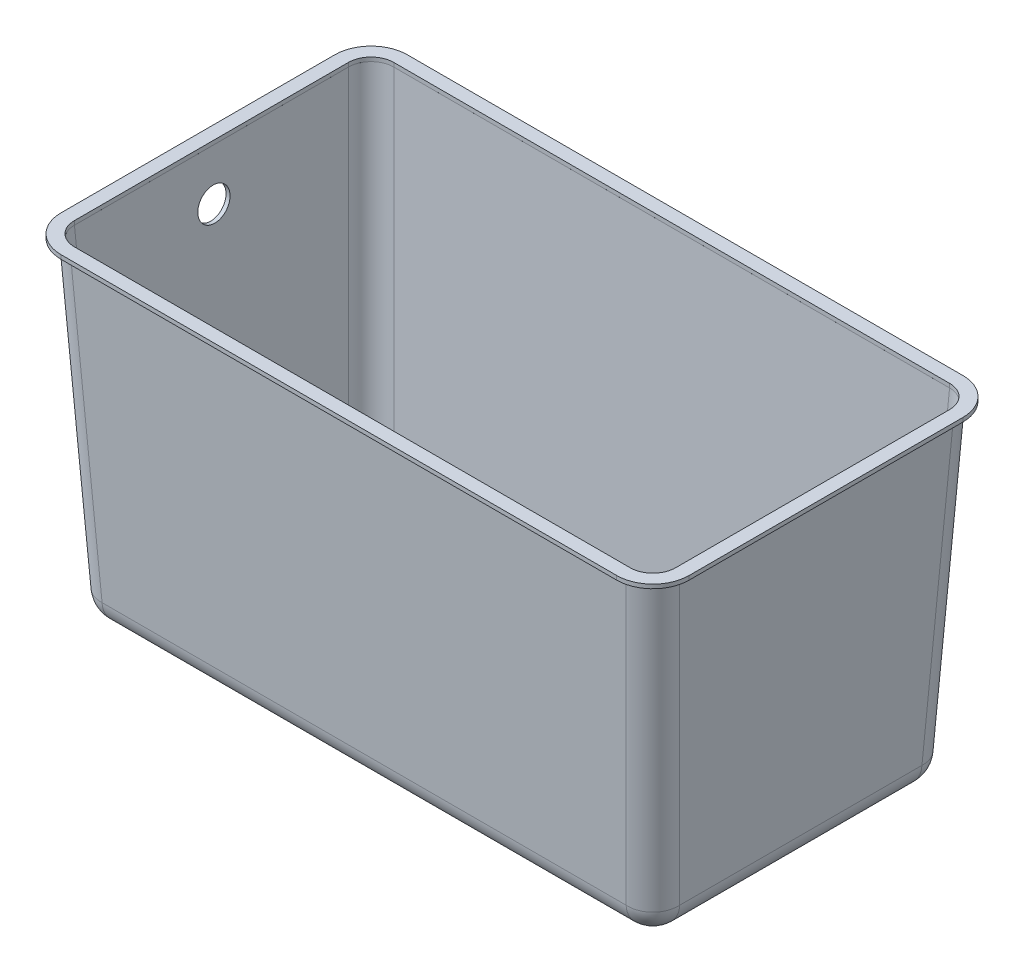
ISO-10303-21;
HEADER;
FILE_DESCRIPTION(('STEP AP214'),'2;1');
FILE_NAME('part.step','',(''),(''),'','','');
FILE_SCHEMA(('AUTOMOTIVE_DESIGN { 1 0 10303 214 1 1 1 1 }'));
ENDSEC;
DATA;
#1=APPLICATION_CONTEXT('core data for automotive mechanical design processes');
#2=APPLICATION_PROTOCOL_DEFINITION('international standard','automotive_design',2000,#1);
#3=PRODUCT_CONTEXT('',#1,'mechanical');
#4=PRODUCT('Part','Part','',(#3));
#5=PRODUCT_RELATED_PRODUCT_CATEGORY('part','',(#4));
#6=PRODUCT_DEFINITION_FORMATION('','',#4);
#7=PRODUCT_DEFINITION_CONTEXT('part definition',#1,'design');
#8=PRODUCT_DEFINITION('design','',#6,#7);
#9=PRODUCT_DEFINITION_SHAPE('','',#8);
#10=(LENGTH_UNIT() NAMED_UNIT(*) SI_UNIT(.MILLI.,.METRE.));
#11=(NAMED_UNIT(*) PLANE_ANGLE_UNIT() SI_UNIT($,.RADIAN.));
#12=(NAMED_UNIT(*) SI_UNIT($,.STERADIAN.) SOLID_ANGLE_UNIT());
#13=UNCERTAINTY_MEASURE_WITH_UNIT(LENGTH_MEASURE(1.E-05),#10,'distance_accuracy_value','');
#14=(GEOMETRIC_REPRESENTATION_CONTEXT(3) GLOBAL_UNCERTAINTY_ASSIGNED_CONTEXT((#13)) GLOBAL_UNIT_ASSIGNED_CONTEXT((#10,
#11,#12)) REPRESENTATION_CONTEXT('',''));
#15=CARTESIAN_POINT('',(0.,0.,0.));
#16=DIRECTION('',(0.,0.,1.));
#17=DIRECTION('',(1.,0.,0.));
#18=AXIS2_PLACEMENT_3D('',#15,#16,#17);
#19=CARTESIAN_POINT('',(0.,0.,-244.));
#20=DIRECTION('',(0.,-1.,0.));
#21=DIRECTION('',(0.,0.,-1.));
#22=AXIS2_PLACEMENT_3D('',#19,#20,#21);
#23=PLANE('',#22);
#24=DIRECTION('',(1.,0.,0.));
#25=VECTOR('',#24,1.);
#26=CARTESIAN_POINT('',(19.9725906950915,0.,-2.99999999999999));
#27=LINE('',#26,#25);
#28=CARTESIAN_POINT('',(19.9725906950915,0.,-2.99999999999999));
#29=VERTEX_POINT('',#28);
#30=CARTESIAN_POINT('',(434.027409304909,0.,-3.00000000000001));
#31=VERTEX_POINT('',#30);
#32=EDGE_CURVE('E284',#29,#31,#27,.T.);
#33=ORIENTED_EDGE('',*,*,#32,.T.);
#34=CARTESIAN_POINT('',(434.027409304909,0.,-3.));
#35=CARTESIAN_POINT('',(436.23621848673,0.,-3.));
#36=CARTESIAN_POINT('',(439.598183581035,0.,-3.66950892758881));
#37=CARTESIAN_POINT('',(443.504883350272,0.,-5.75707579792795));
#38=CARTESIAN_POINT('',(446.976545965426,0.,-8.59785133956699));
#39=CARTESIAN_POINT('',(449.478350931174,0.,-12.3486799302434));
#40=CARTESIAN_POINT('',(450.778378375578,0.,-16.6176449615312));
#41=CARTESIAN_POINT('',(451.,0.,-18.8576735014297));
#42=CARTESIAN_POINT('',(451.,0.,-19.9725906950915));
#43=B_SPLINE_CURVE_WITH_KNOTS('',3,(#34,#35,#36,#37,#38,#39,#40,#41,#42),.UNSPECIFIED.,.F.,.F.,
(4,1,1,1,1,1,4),(0.,0.25,0.375,0.5,0.75,0.875,1.),.UNSPECIFIED.);
#44=CARTESIAN_POINT('',(451.,0.,-19.9725906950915));
#45=VERTEX_POINT('',#44);
#46=EDGE_CURVE('E273',#31,#45,#43,.T.);
#47=ORIENTED_EDGE('',*,*,#46,.T.);
#48=DIRECTION('',(0.,0.,-1.));
#49=VECTOR('',#48,1.);
#50=CARTESIAN_POINT('',(451.,0.,-19.9725906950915));
#51=LINE('',#50,#49);
#52=CARTESIAN_POINT('',(451.,0.,-224.027409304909));
#53=VERTEX_POINT('',#52);
#54=EDGE_CURVE('E261',#45,#53,#51,.T.);
#55=ORIENTED_EDGE('',*,*,#54,.T.);
#56=CARTESIAN_POINT('',(451.,0.,-224.027409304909));
#57=CARTESIAN_POINT('',(451.,0.,-226.23621848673));
#58=CARTESIAN_POINT('',(450.330491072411,0.,-229.598183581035));
#59=CARTESIAN_POINT('',(448.242924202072,0.,-233.504883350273));
#60=CARTESIAN_POINT('',(445.402148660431,0.,-236.976545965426));
#61=CARTESIAN_POINT('',(441.651320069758,0.,-239.478350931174));
#62=CARTESIAN_POINT('',(437.382355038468,0.,-240.778378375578));
#63=CARTESIAN_POINT('',(435.14232649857,0.,-241.));
#64=CARTESIAN_POINT('',(434.027409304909,0.,-241.));
#65=B_SPLINE_CURVE_WITH_KNOTS('',3,(#56,#57,#58,#59,#60,#61,#62,#63,#64),.UNSPECIFIED.,.F.,.F.,
(4,1,1,1,1,1,4),(0.,0.25,0.375,0.5,0.75,0.875,1.),.UNSPECIFIED.);
#66=CARTESIAN_POINT('',(434.027409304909,0.,-241.));
#67=VERTEX_POINT('',#66);
#68=EDGE_CURVE('E272',#53,#67,#65,.T.);
#69=ORIENTED_EDGE('',*,*,#68,.T.);
#70=DIRECTION('',(-1.,0.,0.));
#71=VECTOR('',#70,1.);
#72=CARTESIAN_POINT('',(434.027409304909,0.,-241.));
#73=LINE('',#72,#71);
#74=CARTESIAN_POINT('',(19.9725906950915,0.,-241.));
#75=VERTEX_POINT('',#74);
#76=EDGE_CURVE('E300',#67,#75,#73,.T.);
#77=ORIENTED_EDGE('',*,*,#76,.T.);
#78=CARTESIAN_POINT('',(19.9725906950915,0.,-241.));
#79=CARTESIAN_POINT('',(17.76378151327,0.,-241.));
#80=CARTESIAN_POINT('',(14.4018164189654,0.,-240.330491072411));
#81=CARTESIAN_POINT('',(10.4951166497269,0.,-238.242924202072));
#82=CARTESIAN_POINT('',(7.0234540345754,0.,-235.402148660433));
#83=CARTESIAN_POINT('',(4.52164906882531,0.,-231.651320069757));
#84=CARTESIAN_POINT('',(3.22162162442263,0.,-227.382355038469));
#85=CARTESIAN_POINT('',(2.99999999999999,0.,-225.14232649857));
#86=CARTESIAN_POINT('',(2.99999999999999,0.,-224.027409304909));
#87=B_SPLINE_CURVE_WITH_KNOTS('',3,(#78,#79,#80,#81,#82,#83,#84,#85,#86),.UNSPECIFIED.,.F.,.F.,
(4,1,1,1,1,1,4),(0.,0.25,0.375,0.5,0.75,0.875,1.),.UNSPECIFIED.);
#88=CARTESIAN_POINT('',(2.99999999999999,0.,-224.027409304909));
#89=VERTEX_POINT('',#88);
#90=EDGE_CURVE('E306',#75,#89,#87,.T.);
#91=ORIENTED_EDGE('',*,*,#90,.T.);
#92=DIRECTION('',(0.,0.,1.));
#93=VECTOR('',#92,1.);
#94=CARTESIAN_POINT('',(2.99999999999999,0.,-224.027409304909));
#95=LINE('',#94,#93);
#96=CARTESIAN_POINT('',(3.,0.,-19.9725906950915));
#97=VERTEX_POINT('',#96);
#98=EDGE_CURVE('E311',#89,#97,#95,.T.);
#99=ORIENTED_EDGE('',*,*,#98,.T.);
#100=CARTESIAN_POINT('',(3.,0.,-19.9725906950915));
#101=CARTESIAN_POINT('',(3.,0.,-17.7637815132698));
#102=CARTESIAN_POINT('',(3.66950892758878,0.,-14.4018164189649));
#103=CARTESIAN_POINT('',(5.75707579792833,0.,-10.4951166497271));
#104=CARTESIAN_POINT('',(8.59785133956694,0.,-7.02345403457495));
#105=CARTESIAN_POINT('',(12.3486799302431,0.,-4.52164906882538));
#106=CARTESIAN_POINT('',(16.6176449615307,0.,-3.22162162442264));
#107=CARTESIAN_POINT('',(18.8576735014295,0.,-2.99999999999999));
#108=CARTESIAN_POINT('',(19.9725906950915,0.,-2.99999999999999));
#109=B_SPLINE_CURVE_WITH_KNOTS('',3,(#100,#101,#102,#103,#104,#105,#106,#107,#108),
.UNSPECIFIED.,.F.,.F.,(4,1,1,1,1,1,4),(0.,0.25,0.375,0.5,0.75,0.875,1.),.UNSPECIFIED.);
#110=EDGE_CURVE('E317',#97,#29,#109,.T.);
#111=ORIENTED_EDGE('',*,*,#110,.T.);
#112=EDGE_LOOP('',(#33,#47,#55,#69,#77,#91,#99,#111));
#113=FACE_BOUND('',#112,.T.);
#114=DIRECTION('',(0.,0.,-1.));
#115=VECTOR('',#114,1.);
#116=CARTESIAN_POINT('',(450.995882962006,0.,0.));
#117=LINE('',#116,#115);
#118=CARTESIAN_POINT('',(450.995882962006,0.,-19.9808191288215));
#119=VERTEX_POINT('',#118);
#120=CARTESIAN_POINT('',(450.995882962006,0.,-224.019180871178));
#121=VERTEX_POINT('',#120);
#122=EDGE_CURVE('E861',#119,#121,#117,.T.);
#123=ORIENTED_EDGE('',*,*,#122,.F.);
#124=CARTESIAN_POINT('',(433.972553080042,0.,-20.0274469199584));
#125=DIRECTION('',(0.,-1.,0.));
#126=DIRECTION('',(0.707106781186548,0.,0.707106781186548));
#127=AXIS2_PLACEMENT_3D('',#124,#125,#126);
#128=ELLIPSE('',#127,17.0466278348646,17.);
#129=CARTESIAN_POINT('',(434.019180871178,0.,-3.00411703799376));
#130=VERTEX_POINT('',#129);
#131=EDGE_CURVE('E865',#130,#119,#128,.F.);
#132=ORIENTED_EDGE('',*,*,#131,.F.);
#133=DIRECTION('',(1.,0.,0.));
#134=VECTOR('',#133,1.);
#135=CARTESIAN_POINT('',(0.,0.,-3.00411703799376));
#136=LINE('',#135,#134);
#137=CARTESIAN_POINT('',(19.9808191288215,0.,-3.00411703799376));
#138=VERTEX_POINT('',#137);
#139=EDGE_CURVE('E49',#138,#130,#136,.T.);
#140=ORIENTED_EDGE('',*,*,#139,.F.);
#141=CARTESIAN_POINT('',(20.0274469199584,0.,-20.0274469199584));
#142=DIRECTION('',(0.,-1.,0.));
#143=DIRECTION('',(-0.707106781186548,0.,0.707106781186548));
#144=AXIS2_PLACEMENT_3D('',#141,#142,#143);
#145=ELLIPSE('',#144,17.0466278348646,17.);
#146=CARTESIAN_POINT('',(3.00411703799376,0.,-19.9808191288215));
#147=VERTEX_POINT('',#146);
#148=EDGE_CURVE('E855',#147,#138,#145,.F.);
#149=ORIENTED_EDGE('',*,*,#148,.F.);
#150=DIRECTION('',(0.,0.,1.));
#151=VECTOR('',#150,1.);
#152=CARTESIAN_POINT('',(3.00411703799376,0.,0.));
#153=LINE('',#152,#151);
#154=CARTESIAN_POINT('',(3.00411703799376,0.,-224.019180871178));
#155=VERTEX_POINT('',#154);
#156=EDGE_CURVE('E870',#155,#147,#153,.T.);
#157=ORIENTED_EDGE('',*,*,#156,.F.);
#158=CARTESIAN_POINT('',(20.0274469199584,0.,-223.972553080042));
#159=DIRECTION('',(0.,-1.,0.));
#160=DIRECTION('',(-0.707106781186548,0.,-0.707106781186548));
#161=AXIS2_PLACEMENT_3D('',#158,#159,#160);
#162=ELLIPSE('',#161,17.0466278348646,17.);
#163=CARTESIAN_POINT('',(19.9808191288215,0.,-240.995882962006));
#164=VERTEX_POINT('',#163);
#165=EDGE_CURVE('E853',#164,#155,#162,.F.);
#166=ORIENTED_EDGE('',*,*,#165,.F.);
#167=DIRECTION('',(-1.,0.,0.));
#168=VECTOR('',#167,1.);
#169=CARTESIAN_POINT('',(0.,0.,-240.995882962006));
#170=LINE('',#169,#168);
#171=CARTESIAN_POINT('',(434.019180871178,0.,-240.995882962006));
#172=VERTEX_POINT('',#171);
#173=EDGE_CURVE('E857',#172,#164,#170,.T.);
#174=ORIENTED_EDGE('',*,*,#173,.F.);
#175=CARTESIAN_POINT('',(433.972553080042,0.,-223.972553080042));
#176=DIRECTION('',(0.,-1.,0.));
#177=DIRECTION('',(0.707106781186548,0.,-0.707106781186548));
#178=AXIS2_PLACEMENT_3D('',#175,#176,#177);
#179=ELLIPSE('',#178,17.0466278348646,17.);
#180=EDGE_CURVE('E862',#121,#172,#179,.F.);
#181=ORIENTED_EDGE('',*,*,#180,.F.);
#182=EDGE_LOOP('',(#123,#132,#140,#149,#157,#166,#174,#181));
#183=FACE_BOUND('',#182,.T.);
#184=ADVANCED_FACE('F26',(#113,#183),#23,.F.);
#185=CARTESIAN_POINT('',(2.99588860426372,0.157007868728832,0.));
#186=DIRECTION('',(-0.998629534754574,-0.0523359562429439,0.));
#187=DIRECTION('',(0.0523359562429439,-0.998629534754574,0.));
#188=AXIS2_PLACEMENT_3D('',#185,#186,#187);
#189=PLANE('',#188);
#190=CARTESIAN_POINT('',(4.91336079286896,-36.430541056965,-122.));
#191=DIRECTION('',(-0.998629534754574,-0.0523359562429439,0.));
#192=DIRECTION('',(0.052335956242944,-0.998629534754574,0.));
#193=AXIS2_PLACEMENT_3D('',#190,#191,#192);
#194=CIRCLE('',#193,12.);
#195=CARTESIAN_POINT('',(5.54139226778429,-48.4140954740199,-122.));
#196=VERTEX_POINT('',#195);
#197=EDGE_CURVE('E285',#196,#196,#194,.T.);
#198=ORIENTED_EDGE('',*,*,#197,.T.);
#199=EDGE_LOOP('',(#198));
#200=FACE_BOUND('',#199,.T.);
#201=DIRECTION('',(0.,0.,1.));
#202=VECTOR('',#201,1.);
#203=CARTESIAN_POINT('',(14.7900873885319,-224.88971125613,0.));
#204=LINE('',#203,#202);
#205=CARTESIAN_POINT('',(14.7900873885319,-224.88971125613,-212.23321052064));
#206=VERTEX_POINT('',#205);
#207=CARTESIAN_POINT('',(14.7900873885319,-224.88971125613,-31.7667894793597));
#208=VERTEX_POINT('',#207);
#209=EDGE_CURVE('E935',#206,#208,#204,.T.);
#210=ORIENTED_EDGE('',*,*,#209,.F.);
#211=DIRECTION('',(-0.052264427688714,0.997264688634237,-0.052264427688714));
#212=VECTOR('',#211,1.);
#213=CARTESIAN_POINT('',(2.94133206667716,1.19800861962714,-224.081965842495));
#214=LINE('',#213,#212);
#215=EDGE_CURVE('E928',#155,#206,#214,.F.);
#216=ORIENTED_EDGE('',*,*,#215,.F.);
#217=ORIENTED_EDGE('',*,*,#156,.T.);
#218=DIRECTION('',(-0.052264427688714,0.997264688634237,0.052264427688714));
#219=VECTOR('',#218,1.);
#220=CARTESIAN_POINT('',(2.94133206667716,1.19800861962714,-19.9180341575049));
#221=LINE('',#220,#219);
#222=EDGE_CURVE('E852',#208,#147,#221,.T.);
#223=ORIENTED_EDGE('',*,*,#222,.F.);
#224=EDGE_LOOP('',(#210,#216,#217,#223));
#225=FACE_BOUND('',#224,.T.);
#226=ADVANCED_FACE('F415',(#200,#225),#189,.F.);
#227=CARTESIAN_POINT('',(0.,0.157007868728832,-241.004111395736));
#228=DIRECTION('',(0.,-0.0523359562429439,-0.998629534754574));
#229=DIRECTION('',(0.,0.998629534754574,-0.0523359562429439));
#230=AXIS2_PLACEMENT_3D('',#227,#228,#229);
#231=PLANE('',#230);
#232=ORIENTED_EDGE('',*,*,#173,.T.);
#233=DIRECTION('',(-0.052264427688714,0.997264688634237,-0.052264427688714));
#234=VECTOR('',#233,1.);
#235=CARTESIAN_POINT('',(19.9180341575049,1.19800861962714,-241.058667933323));
#236=LINE('',#235,#234);
#237=CARTESIAN_POINT('',(31.7667894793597,-224.88971125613,-229.209912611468));
#238=VERTEX_POINT('',#237);
#239=EDGE_CURVE('E860',#238,#164,#236,.T.);
#240=ORIENTED_EDGE('',*,*,#239,.F.);
#241=DIRECTION('',(1.,0.,0.));
#242=VECTOR('',#241,1.);
#243=CARTESIAN_POINT('',(0.,-224.88971125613,-229.209912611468));
#244=LINE('',#243,#242);
#245=CARTESIAN_POINT('',(422.23321052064,-224.88971125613,-229.209912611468));
#246=VERTEX_POINT('',#245);
#247=EDGE_CURVE('E888',#246,#238,#244,.F.);
#248=ORIENTED_EDGE('',*,*,#247,.F.);
#249=DIRECTION('',(0.052264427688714,0.997264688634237,-0.052264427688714));
#250=VECTOR('',#249,1.);
#251=CARTESIAN_POINT('',(433.415462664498,-11.5196296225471,-240.392164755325));
#252=LINE('',#251,#250);
#253=EDGE_CURVE('E891',#172,#246,#252,.F.);
#254=ORIENTED_EDGE('',*,*,#253,.F.);
#255=EDGE_LOOP('',(#232,#240,#248,#254));
#256=FACE_BOUND('',#255,.T.);
#257=ADVANCED_FACE('F690',(#256),#231,.F.);
#258=CARTESIAN_POINT('',(451.004111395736,0.157007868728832,0.));
#259=DIRECTION('',(0.998629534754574,-0.0523359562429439,0.));
#260=DIRECTION('',(0.0523359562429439,0.998629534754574,0.));
#261=AXIS2_PLACEMENT_3D('',#258,#259,#260);
#262=PLANE('',#261);
#263=DIRECTION('',(0.,0.,1.));
#264=VECTOR('',#263,1.);
#265=CARTESIAN_POINT('',(439.209912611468,-224.88971125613,0.));
#266=LINE('',#265,#264);
#267=CARTESIAN_POINT('',(439.209912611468,-224.88971125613,-31.7667894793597));
#268=VERTEX_POINT('',#267);
#269=CARTESIAN_POINT('',(439.209912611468,-224.88971125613,-212.23321052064));
#270=VERTEX_POINT('',#269);
#271=EDGE_CURVE('E921',#268,#270,#266,.F.);
#272=ORIENTED_EDGE('',*,*,#271,.F.);
#273=DIRECTION('',(0.052264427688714,0.997264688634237,0.052264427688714));
#274=VECTOR('',#273,1.);
#275=CARTESIAN_POINT('',(449.818534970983,-22.4651379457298,-21.1581671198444));
#276=LINE('',#275,#274);
#277=EDGE_CURVE('E913',#119,#268,#276,.F.);
#278=ORIENTED_EDGE('',*,*,#277,.F.);
#279=ORIENTED_EDGE('',*,*,#122,.T.);
#280=DIRECTION('',(0.052264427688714,0.997264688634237,-0.052264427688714));
#281=VECTOR('',#280,1.);
#282=CARTESIAN_POINT('',(450.392164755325,-11.5196296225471,-223.415462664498));
#283=LINE('',#282,#281);
#284=EDGE_CURVE('E856',#270,#121,#283,.T.);
#285=ORIENTED_EDGE('',*,*,#284,.F.);
#286=EDGE_LOOP('',(#272,#278,#279,#285));
#287=FACE_BOUND('',#286,.T.);
#288=ADVANCED_FACE('F1150',(#287),#262,.F.);
#289=CARTESIAN_POINT('',(0.,0.157007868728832,-2.99588860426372));
#290=DIRECTION('',(0.,-0.0523359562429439,0.998629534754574));
#291=DIRECTION('',(0.,-0.998629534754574,-0.0523359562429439));
#292=AXIS2_PLACEMENT_3D('',#289,#290,#291);
#293=PLANE('',#292);
#294=DIRECTION('',(1.,0.,0.));
#295=VECTOR('',#294,1.);
#296=CARTESIAN_POINT('',(0.,-224.88971125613,-14.7900873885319));
#297=LINE('',#296,#295);
#298=CARTESIAN_POINT('',(31.7667894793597,-224.88971125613,-14.7900873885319));
#299=VERTEX_POINT('',#298);
#300=CARTESIAN_POINT('',(422.23321052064,-224.88971125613,-14.7900873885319));
#301=VERTEX_POINT('',#300);
#302=EDGE_CURVE('E929',#299,#301,#297,.T.);
#303=ORIENTED_EDGE('',*,*,#302,.F.);
#304=DIRECTION('',(-0.052264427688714,0.997264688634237,0.052264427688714));
#305=VECTOR('',#304,1.);
#306=CARTESIAN_POINT('',(19.9180341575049,1.19800861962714,-2.94133206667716));
#307=LINE('',#306,#305);
#308=EDGE_CURVE('E864',#138,#299,#307,.F.);
#309=ORIENTED_EDGE('',*,*,#308,.F.);
#310=ORIENTED_EDGE('',*,*,#139,.T.);
#311=DIRECTION('',(0.052264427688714,0.997264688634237,0.052264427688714));
#312=VECTOR('',#311,1.);
#313=CARTESIAN_POINT('',(432.841832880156,-22.4651379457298,-4.18146502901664));
#314=LINE('',#313,#312);
#315=EDGE_CURVE('E926',#301,#130,#314,.T.);
#316=ORIENTED_EDGE('',*,*,#315,.F.);
#317=EDGE_LOOP('',(#303,#309,#310,#316));
#318=FACE_BOUND('',#317,.T.);
#319=ADVANCED_FACE('F1146',(#318),#293,.F.);
#320=CARTESIAN_POINT('',(0.,-241.,-244.));
#321=DIRECTION('',(0.,-1.,0.));
#322=DIRECTION('',(0.,0.,-1.));
#323=AXIS2_PLACEMENT_3D('',#320,#321,#322);
#324=PLANE('',#323);
#325=DIRECTION('',(0.,0.,-1.));
#326=VECTOR('',#325,1.);
#327=CARTESIAN_POINT('',(31.7667894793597,-241.,-244.));
#328=LINE('',#327,#326);
#329=CARTESIAN_POINT('',(31.7667894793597,-241.,-31.7667894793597));
#330=VERTEX_POINT('',#329);
#331=CARTESIAN_POINT('',(31.7667894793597,-241.,-212.23321052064));
#332=VERTEX_POINT('',#331);
#333=EDGE_CURVE('E893',#330,#332,#328,.T.);
#334=ORIENTED_EDGE('',*,*,#333,.F.);
#335=DIRECTION('',(1.,0.,0.));
#336=VECTOR('',#335,1.);
#337=CARTESIAN_POINT('',(0.,-241.,-31.7667894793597));
#338=LINE('',#337,#336);
#339=CARTESIAN_POINT('',(422.23321052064,-241.,-31.7667894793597));
#340=VERTEX_POINT('',#339);
#341=EDGE_CURVE('E906',#340,#330,#338,.F.);
#342=ORIENTED_EDGE('',*,*,#341,.F.);
#343=DIRECTION('',(0.,0.,-1.));
#344=VECTOR('',#343,1.);
#345=CARTESIAN_POINT('',(422.23321052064,-241.,-244.));
#346=LINE('',#345,#344);
#347=CARTESIAN_POINT('',(422.23321052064,-241.,-212.23321052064));
#348=VERTEX_POINT('',#347);
#349=EDGE_CURVE('E908',#348,#340,#346,.F.);
#350=ORIENTED_EDGE('',*,*,#349,.F.);
#351=DIRECTION('',(1.,0.,0.));
#352=VECTOR('',#351,1.);
#353=CARTESIAN_POINT('',(0.,-241.,-212.23321052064));
#354=LINE('',#353,#352);
#355=EDGE_CURVE('E910',#332,#348,#354,.T.);
#356=ORIENTED_EDGE('',*,*,#355,.F.);
#357=EDGE_LOOP('',(#334,#342,#350,#356));
#358=FACE_BOUND('',#357,.T.);
#359=ADVANCED_FACE('F1142',(#358),#324,.F.);
#360=CARTESIAN_POINT('',(432.841832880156,-21.5754266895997,-21.1581671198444));
#361=DIRECTION('',(0.052264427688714,0.997264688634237,0.052264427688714));
#362=DIRECTION('',(0.,-0.052335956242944,0.998629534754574));
#363=AXIS2_PLACEMENT_3D('',#360,#361,#362);
#364=CYLINDRICAL_SURFACE('',#363,17.);
#365=ORIENTED_EDGE('',*,*,#131,.T.);
#366=ORIENTED_EDGE('',*,*,#277,.T.);
#367=CARTESIAN_POINT('',(422.23321052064,-224.,-31.7667894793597));
#368=DIRECTION('',(0.052264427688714,0.997264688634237,0.052264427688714));
#369=DIRECTION('',(0.,-0.052335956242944,0.998629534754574));
#370=AXIS2_PLACEMENT_3D('',#367,#368,#369);
#371=CIRCLE('',#370,17.);
#372=EDGE_CURVE('E919',#268,#301,#371,.F.);
#373=ORIENTED_EDGE('',*,*,#372,.T.);
#374=ORIENTED_EDGE('',*,*,#315,.T.);
#375=EDGE_LOOP('',(#365,#366,#373,#374));
#376=FACE_BOUND('',#375,.T.);
#377=ADVANCED_FACE('F1138',(#376),#364,.F.);
#378=CARTESIAN_POINT('',(19.9180341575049,2.08771987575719,-19.9180341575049));
#379=DIRECTION('',(-0.052264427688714,0.997264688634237,0.052264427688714));
#380=DIRECTION('',(0.,-0.052335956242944,0.998629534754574));
#381=AXIS2_PLACEMENT_3D('',#378,#379,#380);
#382=CYLINDRICAL_SURFACE('',#381,17.);
#383=ORIENTED_EDGE('',*,*,#148,.T.);
#384=ORIENTED_EDGE('',*,*,#308,.T.);
#385=CARTESIAN_POINT('',(31.7667894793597,-224.,-31.7667894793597));
#386=DIRECTION('',(-0.052264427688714,0.997264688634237,0.052264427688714));
#387=DIRECTION('',(0.,-0.052335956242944,0.998629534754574));
#388=AXIS2_PLACEMENT_3D('',#385,#386,#387);
#389=CIRCLE('',#388,17.);
#390=EDGE_CURVE('E905',#299,#208,#389,.F.);
#391=ORIENTED_EDGE('',*,*,#390,.T.);
#392=ORIENTED_EDGE('',*,*,#222,.T.);
#393=EDGE_LOOP('',(#383,#384,#391,#392));
#394=FACE_BOUND('',#393,.T.);
#395=ADVANCED_FACE('F1134',(#394),#382,.F.);
#396=CARTESIAN_POINT('',(0.,-224.,-31.7667894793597));
#397=DIRECTION('',(1.,0.,0.));
#398=DIRECTION('',(0.,0.,-1.));
#399=AXIS2_PLACEMENT_3D('',#396,#397,#398);
#400=CYLINDRICAL_SURFACE('',#399,17.);
#401=CARTESIAN_POINT('',(422.23321052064,-224.,-31.7667894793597));
#402=DIRECTION('',(-1.,0.,0.));
#403=DIRECTION('',(0.,-1.,0.));
#404=AXIS2_PLACEMENT_3D('',#401,#402,#403);
#405=CIRCLE('',#404,17.);
#406=EDGE_CURVE('E874',#301,#340,#405,.F.);
#407=ORIENTED_EDGE('',*,*,#406,.T.);
#408=ORIENTED_EDGE('',*,*,#341,.T.);
#409=CARTESIAN_POINT('',(31.7667894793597,-224.,-31.7667894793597));
#410=DIRECTION('',(-1.,0.,0.));
#411=DIRECTION('',(0.,-1.,0.));
#412=AXIS2_PLACEMENT_3D('',#409,#410,#411);
#413=CIRCLE('',#412,17.);
#414=EDGE_CURVE('E902',#330,#299,#413,.T.);
#415=ORIENTED_EDGE('',*,*,#414,.T.);
#416=ORIENTED_EDGE('',*,*,#302,.T.);
#417=EDGE_LOOP('',(#407,#408,#415,#416));
#418=FACE_BOUND('',#417,.T.);
#419=ADVANCED_FACE('F1130',(#418),#400,.F.);
#420=CARTESIAN_POINT('',(422.23321052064,-224.,-31.7667894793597));
#421=DIRECTION('',(0.,0.,1.));
#422=DIRECTION('',(1.,0.,0.));
#423=AXIS2_PLACEMENT_3D('',#420,#421,#422);
#424=SPHERICAL_SURFACE('',#423,17.);
#425=ORIENTED_EDGE('',*,*,#372,.F.);
#426=CARTESIAN_POINT('',(422.23321052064,-224.,-31.7667894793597));
#427=DIRECTION('',(0.,0.,-1.));
#428=DIRECTION('',(-1.,0.,0.));
#429=AXIS2_PLACEMENT_3D('',#426,#427,#428);
#430=CIRCLE('',#429,17.);
#431=EDGE_CURVE('E901',#268,#340,#430,.T.);
#432=ORIENTED_EDGE('',*,*,#431,.T.);
#433=ORIENTED_EDGE('',*,*,#406,.F.);
#434=EDGE_LOOP('',(#425,#432,#433));
#435=FACE_BOUND('',#434,.T.);
#436=ADVANCED_FACE('F1126',(#435),#424,.F.);
#437=CARTESIAN_POINT('',(31.7667894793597,-224.,-31.7667894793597));
#438=DIRECTION('',(0.,0.,1.));
#439=DIRECTION('',(1.,0.,0.));
#440=AXIS2_PLACEMENT_3D('',#437,#438,#439);
#441=SPHERICAL_SURFACE('',#440,17.);
#442=ORIENTED_EDGE('',*,*,#414,.F.);
#443=CARTESIAN_POINT('',(31.7667894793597,-224.,-31.7667894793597));
#444=DIRECTION('',(0.,0.,1.));
#445=DIRECTION('',(1.,0.,0.));
#446=AXIS2_PLACEMENT_3D('',#443,#444,#445);
#447=CIRCLE('',#446,17.);
#448=EDGE_CURVE('E883',#330,#208,#447,.F.);
#449=ORIENTED_EDGE('',*,*,#448,.T.);
#450=ORIENTED_EDGE('',*,*,#390,.F.);
#451=EDGE_LOOP('',(#442,#449,#450));
#452=FACE_BOUND('',#451,.T.);
#453=ADVANCED_FACE('F1122',(#452),#441,.F.);
#454=CARTESIAN_POINT('',(422.23321052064,-224.,0.));
#455=DIRECTION('',(0.,0.,-1.));
#456=DIRECTION('',(-1.,0.,0.));
#457=AXIS2_PLACEMENT_3D('',#454,#455,#456);
#458=CYLINDRICAL_SURFACE('',#457,17.);
#459=ORIENTED_EDGE('',*,*,#431,.F.);
#460=ORIENTED_EDGE('',*,*,#271,.T.);
#461=CARTESIAN_POINT('',(422.23321052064,-224.,-212.23321052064));
#462=DIRECTION('',(0.,0.,1.));
#463=DIRECTION('',(1.,0.,0.));
#464=AXIS2_PLACEMENT_3D('',#461,#462,#463);
#465=CIRCLE('',#464,17.);
#466=EDGE_CURVE('E880',#270,#348,#465,.F.);
#467=ORIENTED_EDGE('',*,*,#466,.T.);
#468=ORIENTED_EDGE('',*,*,#349,.T.);
#469=EDGE_LOOP('',(#459,#460,#467,#468));
#470=FACE_BOUND('',#469,.T.);
#471=ADVANCED_FACE('F1118',(#470),#458,.F.);
#472=CARTESIAN_POINT('',(433.415462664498,-10.629918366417,-223.415462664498));
#473=DIRECTION('',(0.052264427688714,0.997264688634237,-0.052264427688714));
#474=DIRECTION('',(0.,0.052335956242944,0.998629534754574));
#475=AXIS2_PLACEMENT_3D('',#472,#473,#474);
#476=CYLINDRICAL_SURFACE('',#475,17.);
#477=ORIENTED_EDGE('',*,*,#180,.T.);
#478=ORIENTED_EDGE('',*,*,#253,.T.);
#479=CARTESIAN_POINT('',(422.23321052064,-224.,-212.23321052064));
#480=DIRECTION('',(0.052264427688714,0.997264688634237,-0.052264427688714));
#481=DIRECTION('',(0.,0.052335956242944,0.998629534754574));
#482=AXIS2_PLACEMENT_3D('',#479,#480,#481);
#483=CIRCLE('',#482,17.);
#484=EDGE_CURVE('E884',#246,#270,#483,.F.);
#485=ORIENTED_EDGE('',*,*,#484,.T.);
#486=ORIENTED_EDGE('',*,*,#284,.T.);
#487=EDGE_LOOP('',(#477,#478,#485,#486));
#488=FACE_BOUND('',#487,.T.);
#489=ADVANCED_FACE('F1114',(#488),#476,.F.);
#490=CARTESIAN_POINT('',(19.9180341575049,2.08771987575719,-224.081965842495));
#491=DIRECTION('',(-0.052264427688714,0.997264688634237,-0.052264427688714));
#492=DIRECTION('',(0.,0.052335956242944,0.998629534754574));
#493=AXIS2_PLACEMENT_3D('',#490,#491,#492);
#494=CYLINDRICAL_SURFACE('',#493,17.);
#495=ORIENTED_EDGE('',*,*,#165,.T.);
#496=ORIENTED_EDGE('',*,*,#215,.T.);
#497=CARTESIAN_POINT('',(31.7667894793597,-224.,-212.23321052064));
#498=DIRECTION('',(-0.052264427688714,0.997264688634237,-0.052264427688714));
#499=DIRECTION('',(0.,0.052335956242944,0.998629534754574));
#500=AXIS2_PLACEMENT_3D('',#497,#498,#499);
#501=CIRCLE('',#500,17.);
#502=EDGE_CURVE('E887',#206,#238,#501,.F.);
#503=ORIENTED_EDGE('',*,*,#502,.T.);
#504=ORIENTED_EDGE('',*,*,#239,.T.);
#505=EDGE_LOOP('',(#495,#496,#503,#504));
#506=FACE_BOUND('',#505,.T.);
#507=ADVANCED_FACE('F1110',(#506),#494,.F.);
#508=CARTESIAN_POINT('',(31.7667894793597,-224.,0.));
#509=DIRECTION('',(0.,0.,1.));
#510=DIRECTION('',(1.,0.,0.));
#511=AXIS2_PLACEMENT_3D('',#508,#509,#510);
#512=CYLINDRICAL_SURFACE('',#511,17.);
#513=ORIENTED_EDGE('',*,*,#448,.F.);
#514=ORIENTED_EDGE('',*,*,#333,.T.);
#515=CARTESIAN_POINT('',(31.7667894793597,-224.,-212.23321052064));
#516=DIRECTION('',(0.,0.,1.));
#517=DIRECTION('',(1.,0.,0.));
#518=AXIS2_PLACEMENT_3D('',#515,#516,#517);
#519=CIRCLE('',#518,17.);
#520=EDGE_CURVE('E879',#332,#206,#519,.F.);
#521=ORIENTED_EDGE('',*,*,#520,.T.);
#522=ORIENTED_EDGE('',*,*,#209,.T.);
#523=EDGE_LOOP('',(#513,#514,#521,#522));
#524=FACE_BOUND('',#523,.T.);
#525=ADVANCED_FACE('F1106',(#524),#512,.F.);
#526=CARTESIAN_POINT('',(422.23321052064,-224.,-212.23321052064));
#527=DIRECTION('',(0.,0.,1.));
#528=DIRECTION('',(1.,0.,0.));
#529=AXIS2_PLACEMENT_3D('',#526,#527,#528);
#530=SPHERICAL_SURFACE('',#529,17.);
#531=ORIENTED_EDGE('',*,*,#484,.F.);
#532=CARTESIAN_POINT('',(422.23321052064,-224.,-212.23321052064));
#533=DIRECTION('',(-1.,0.,0.));
#534=DIRECTION('',(0.,0.,1.));
#535=AXIS2_PLACEMENT_3D('',#532,#533,#534);
#536=CIRCLE('',#535,17.);
#537=EDGE_CURVE('E877',#246,#348,#536,.T.);
#538=ORIENTED_EDGE('',*,*,#537,.T.);
#539=ORIENTED_EDGE('',*,*,#466,.F.);
#540=EDGE_LOOP('',(#531,#538,#539));
#541=FACE_BOUND('',#540,.T.);
#542=ADVANCED_FACE('F1102',(#541),#530,.F.);
#543=CARTESIAN_POINT('',(31.7667894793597,-224.,-212.23321052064));
#544=DIRECTION('',(0.,0.,1.));
#545=DIRECTION('',(1.,0.,0.));
#546=AXIS2_PLACEMENT_3D('',#543,#544,#545);
#547=SPHERICAL_SURFACE('',#546,17.);
#548=ORIENTED_EDGE('',*,*,#520,.F.);
#549=CARTESIAN_POINT('',(31.7667894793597,-224.,-212.23321052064));
#550=DIRECTION('',(-1.,0.,0.));
#551=DIRECTION('',(0.,0.,1.));
#552=AXIS2_PLACEMENT_3D('',#549,#550,#551);
#553=CIRCLE('',#552,17.);
#554=EDGE_CURVE('E875',#332,#238,#553,.F.);
#555=ORIENTED_EDGE('',*,*,#554,.T.);
#556=ORIENTED_EDGE('',*,*,#502,.F.);
#557=EDGE_LOOP('',(#548,#555,#556));
#558=FACE_BOUND('',#557,.T.);
#559=ADVANCED_FACE('F1098',(#558),#547,.F.);
#560=CARTESIAN_POINT('',(0.,-224.,-212.23321052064));
#561=DIRECTION('',(-1.,0.,0.));
#562=DIRECTION('',(0.,0.,1.));
#563=AXIS2_PLACEMENT_3D('',#560,#561,#562);
#564=CYLINDRICAL_SURFACE('',#563,17.);
#565=ORIENTED_EDGE('',*,*,#537,.F.);
#566=ORIENTED_EDGE('',*,*,#247,.T.);
#567=ORIENTED_EDGE('',*,*,#554,.F.);
#568=ORIENTED_EDGE('',*,*,#355,.T.);
#569=EDGE_LOOP('',(#565,#566,#567,#568));
#570=FACE_BOUND('',#569,.T.);
#571=ADVANCED_FACE('F614',(#570),#564,.F.);
#572=CARTESIAN_POINT('',(453.09631029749,3.,-0.889861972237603));
#573=DIRECTION('',(0.,-1.,0.));
#574=DIRECTION('',(0.,0.,-1.));
#575=AXIS2_PLACEMENT_3D('',#572,#573,#574);
#576=PLANE('',#575);
#577=CARTESIAN_POINT('',(461.,3.,-19.9725906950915));
#578=CARTESIAN_POINT('',(461.,3.,-18.1915257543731));
#579=CARTESIAN_POINT('',(460.825646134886,3.,-16.4298221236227));
#580=CARTESIAN_POINT('',(460.391069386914,3.,-14.2517489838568));
#581=CARTESIAN_POINT('',(460.293003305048,3.,-13.8166338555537));
#582=CARTESIAN_POINT('',(460.076691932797,3.,-12.9563846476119));
#583=CARTESIAN_POINT('',(459.958325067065,3.,-12.5304541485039));
#584=CARTESIAN_POINT('',(459.573117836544,3.,-11.2650285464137));
#585=CARTESIAN_POINT('',(458.979365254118,3.,-9.61071204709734));
#586=CARTESIAN_POINT('',(458.227375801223,3.,-8.02138921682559));
#587=CARTESIAN_POINT('',(457.603100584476,3.,-6.8541575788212));
#588=CARTESIAN_POINT('',(457.384943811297,3.,-6.46921444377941));
#589=CARTESIAN_POINT('',(456.928116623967,3.,-5.70775387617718));
#590=CARTESIAN_POINT('',(456.689265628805,3.,-5.33110187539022));
#591=CARTESIAN_POINT('',(455.456923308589,3.,-3.48987622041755));
#592=CARTESIAN_POINT('',(454.340440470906,3.,-2.13308955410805));
#593=CARTESIAN_POINT('',(452.474245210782,3.,-0.268248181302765));
#594=CARTESIAN_POINT('',(451.820041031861,3.,0.324773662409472));
#595=CARTESIAN_POINT('',(450.788962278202,3.,1.17002725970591));
#596=CARTESIAN_POINT('',(450.437560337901,3.,1.44380435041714));
#597=CARTESIAN_POINT('',(449.725857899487,3.,1.97064734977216));
#598=CARTESIAN_POINT('',(449.364675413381,3.,2.22444910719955));
#599=CARTESIAN_POINT('',(447.532526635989,3.,3.44611700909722));
#600=CARTESIAN_POINT('',(445.983597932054,3.,4.2733077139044));
#601=CARTESIAN_POINT('',(443.534303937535,3.,5.28691801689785));
#602=CARTESIAN_POINT('',(442.692340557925,3.,5.58769640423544));
#603=CARTESIAN_POINT('',(440.998471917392,3.,6.10003366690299));
#604=CARTESIAN_POINT('',(440.144196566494,3.,6.31306237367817));
#605=CARTESIAN_POINT('',(437.559847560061,3.,6.82566780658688));
#606=CARTESIAN_POINT('',(435.808461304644,3.,7.));
#607=CARTESIAN_POINT('',(434.027409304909,3.,7.));
#608=B_SPLINE_CURVE_WITH_KNOTS('',3,(#577,#578,#579,#580,#581,#582,#583,#584,#585,#586,#587,
#588,#589,#590,#591,#592,#593,#594,#595,#596,#597,#598,#599,#600,#601,#602,#603,#604,#605,#606,
#607),.UNSPECIFIED.,.F.,.F.,(4,2,2,2,1,2,2,2,2,2,2,2,2,2,2,4),(0.,0.124999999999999,
0.156249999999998,0.187499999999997,0.249999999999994,0.312499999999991,0.34374999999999,
0.374999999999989,0.499999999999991,0.562499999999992,0.593749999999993,0.624999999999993,
0.749999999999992,0.812499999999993,0.874999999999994,1.),.UNSPECIFIED.);
#609=CARTESIAN_POINT('',(434.027409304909,3.,7.));
#610=VERTEX_POINT('',#609);
#611=CARTESIAN_POINT('',(461.,3.,-19.9725906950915));
#612=VERTEX_POINT('',#611);
#613=EDGE_CURVE('E384',#610,#612,#608,.F.);
#614=ORIENTED_EDGE('',*,*,#613,.T.);
#615=DIRECTION('',(0.,0.,-1.));
#616=VECTOR('',#615,1.);
#617=CARTESIAN_POINT('',(461.,3.,-19.9725906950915));
#618=LINE('',#617,#616);
#619=CARTESIAN_POINT('',(461.,3.,-224.027409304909));
#620=VERTEX_POINT('',#619);
#621=EDGE_CURVE('E473',#612,#620,#618,.T.);
#622=ORIENTED_EDGE('',*,*,#621,.T.);
#623=CARTESIAN_POINT('',(434.027409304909,3.,-251.));
#624=CARTESIAN_POINT('',(435.808474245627,3.,-251.));
#625=CARTESIAN_POINT('',(437.570177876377,3.,-250.825646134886));
#626=CARTESIAN_POINT('',(439.748251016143,3.,-250.391069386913));
#627=CARTESIAN_POINT('',(440.183366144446,3.,-250.293003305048));
#628=CARTESIAN_POINT('',(441.043615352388,3.,-250.076691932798));
#629=CARTESIAN_POINT('',(441.469545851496,3.,-249.958325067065));
#630=CARTESIAN_POINT('',(442.734971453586,3.,-249.573117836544));
#631=CARTESIAN_POINT('',(444.389287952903,3.,-248.979365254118));
#632=CARTESIAN_POINT('',(445.978610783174,3.,-248.227375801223));
#633=CARTESIAN_POINT('',(447.145842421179,3.,-247.603100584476));
#634=CARTESIAN_POINT('',(447.530785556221,3.,-247.384943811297));
#635=CARTESIAN_POINT('',(448.292246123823,3.,-246.928116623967));
#636=CARTESIAN_POINT('',(448.66889812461,3.,-246.689265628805));
#637=CARTESIAN_POINT('',(450.510123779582,3.,-245.456923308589));
#638=CARTESIAN_POINT('',(451.866910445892,3.,-244.340440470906));
#639=CARTESIAN_POINT('',(453.731751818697,3.,-242.474245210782));
#640=CARTESIAN_POINT('',(454.324773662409,3.,-241.820041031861));
#641=CARTESIAN_POINT('',(455.170027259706,3.,-240.788962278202));
#642=CARTESIAN_POINT('',(455.443804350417,3.,-240.437560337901));
#643=CARTESIAN_POINT('',(455.970647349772,3.,-239.725857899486));
#644=CARTESIAN_POINT('',(456.2244491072,3.,-239.364675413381));
#645=CARTESIAN_POINT('',(457.446117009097,3.,-237.532526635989));
#646=CARTESIAN_POINT('',(458.273307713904,3.,-235.983597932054));
#647=CARTESIAN_POINT('',(459.286918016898,3.,-233.534303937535));
#648=CARTESIAN_POINT('',(459.587696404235,3.,-232.692340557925));
#649=CARTESIAN_POINT('',(460.100033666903,3.,-230.998471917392));
#650=CARTESIAN_POINT('',(460.313062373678,3.,-230.144196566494));
#651=CARTESIAN_POINT('',(460.825667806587,3.,-227.559847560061));
#652=CARTESIAN_POINT('',(461.,3.,-225.808461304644));
#653=CARTESIAN_POINT('',(461.,3.,-224.027409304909));
#654=B_SPLINE_CURVE_WITH_KNOTS('',3,(#623,#624,#625,#626,#627,#628,#629,#630,#631,#632,#633,
#634,#635,#636,#637,#638,#639,#640,#641,#642,#643,#644,#645,#646,#647,#648,#649,#650,#651,#652,
#653),.UNSPECIFIED.,.F.,.F.,(4,2,2,2,1,2,2,2,2,2,2,2,2,2,2,4),(0.,0.125000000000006,
0.156250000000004,0.187500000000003,0.250000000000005,0.312500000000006,0.343750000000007,
0.375000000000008,0.50000000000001,0.562500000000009,0.593750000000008,0.625000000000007,
0.750000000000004,0.812500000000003,0.875000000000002,1.),.UNSPECIFIED.);
#655=CARTESIAN_POINT('',(434.027409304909,3.,-251.));
#656=VERTEX_POINT('',#655);
#657=EDGE_CURVE('E474',#620,#656,#654,.F.);
#658=ORIENTED_EDGE('',*,*,#657,.T.);
#659=DIRECTION('',(-1.,0.,0.));
#660=VECTOR('',#659,1.);
#661=CARTESIAN_POINT('',(434.027409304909,3.,-251.));
#662=LINE('',#661,#660);
#663=CARTESIAN_POINT('',(19.9725906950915,3.,-251.));
#664=VERTEX_POINT('',#663);
#665=EDGE_CURVE('E476',#656,#664,#662,.T.);
#666=ORIENTED_EDGE('',*,*,#665,.T.);
#667=CARTESIAN_POINT('',(-7.00000000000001,3.,-224.027409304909));
#668=CARTESIAN_POINT('',(-7.00000000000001,3.,-225.808474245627));
#669=CARTESIAN_POINT('',(-6.82564613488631,3.,-227.570177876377));
#670=CARTESIAN_POINT('',(-6.39106938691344,3.,-229.748251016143));
#671=CARTESIAN_POINT('',(-6.29300330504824,3.,-230.183366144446));
#672=CARTESIAN_POINT('',(-6.07669193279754,3.,-231.043615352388));
#673=CARTESIAN_POINT('',(-5.95832506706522,3.,-231.469545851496));
#674=CARTESIAN_POINT('',(-5.57311783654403,3.,-232.734971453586));
#675=CARTESIAN_POINT('',(-4.97936525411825,3.,-234.389287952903));
#676=CARTESIAN_POINT('',(-4.22737580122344,3.,-235.978610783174));
#677=CARTESIAN_POINT('',(-3.6031005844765,3.,-237.145842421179));
#678=CARTESIAN_POINT('',(-3.38494381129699,3.,-237.530785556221));
#679=CARTESIAN_POINT('',(-2.92811662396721,3.,-238.292246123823));
#680=CARTESIAN_POINT('',(-2.68926562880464,3.,-238.66889812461));
#681=CARTESIAN_POINT('',(-1.45692330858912,3.,-240.510123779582));
#682=CARTESIAN_POINT('',(-0.340440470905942,3.,-241.866910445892));
#683=CARTESIAN_POINT('',(1.52575478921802,3.,-243.731751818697));
#684=CARTESIAN_POINT('',(2.17995896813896,3.,-244.324773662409));
#685=CARTESIAN_POINT('',(3.21103772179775,3.,-245.170027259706));
#686=CARTESIAN_POINT('',(3.56243966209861,3.,-245.443804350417));
#687=CARTESIAN_POINT('',(4.27414210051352,3.,-245.970647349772));
#688=CARTESIAN_POINT('',(4.63532458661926,3.,-246.2244491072));
#689=CARTESIAN_POINT('',(6.46747336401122,3.,-247.446117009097));
#690=CARTESIAN_POINT('',(8.01640206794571,3.,-248.273307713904));
#691=CARTESIAN_POINT('',(10.4656960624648,3.,-249.286918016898));
#692=CARTESIAN_POINT('',(11.3076594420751,3.,-249.587696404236));
#693=CARTESIAN_POINT('',(13.0015280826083,3.,-250.100033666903));
#694=CARTESIAN_POINT('',(13.8558034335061,3.,-250.313062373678));
#695=CARTESIAN_POINT('',(16.4401524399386,3.,-250.825667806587));
#696=CARTESIAN_POINT('',(18.1915386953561,3.,-251.));
#697=CARTESIAN_POINT('',(19.9725906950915,3.,-251.));
#698=B_SPLINE_CURVE_WITH_KNOTS('',3,(#667,#668,#669,#670,#671,#672,#673,#674,#675,#676,#677,
#678,#679,#680,#681,#682,#683,#684,#685,#686,#687,#688,#689,#690,#691,#692,#693,#694,#695,#696,
#697),.UNSPECIFIED.,.F.,.F.,(4,2,2,2,1,2,2,2,2,2,2,2,2,2,2,4),(0.,0.125,0.156249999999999,
0.187499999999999,0.249999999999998,0.312499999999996,0.343749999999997,0.374999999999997,
0.499999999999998,0.562499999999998,0.593749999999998,0.624999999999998,0.749999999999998,
0.812499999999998,0.874999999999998,1.),.UNSPECIFIED.);
#699=CARTESIAN_POINT('',(-7.00000000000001,3.,-224.027409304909));
#700=VERTEX_POINT('',#699);
#701=EDGE_CURVE('E492',#664,#700,#698,.F.);
#702=ORIENTED_EDGE('',*,*,#701,.T.);
#703=DIRECTION('',(0.,0.,1.));
#704=VECTOR('',#703,1.);
#705=CARTESIAN_POINT('',(-7.00000000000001,3.,-224.027409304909));
#706=LINE('',#705,#704);
#707=CARTESIAN_POINT('',(-7.,3.,-19.9725906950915));
#708=VERTEX_POINT('',#707);
#709=EDGE_CURVE('E555',#700,#708,#706,.T.);
#710=ORIENTED_EDGE('',*,*,#709,.T.);
#711=CARTESIAN_POINT('',(19.9725906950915,3.,7.00000000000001));
#712=CARTESIAN_POINT('',(18.1915257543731,3.,7.00000000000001));
#713=CARTESIAN_POINT('',(16.4298221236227,3.,6.8256461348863));
#714=CARTESIAN_POINT('',(14.2517489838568,3.,6.39106938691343));
#715=CARTESIAN_POINT('',(13.8166338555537,3.,6.29300330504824));
#716=CARTESIAN_POINT('',(12.9563846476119,3.,6.07669193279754));
#717=CARTESIAN_POINT('',(12.5304541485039,3.,5.95832506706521));
#718=CARTESIAN_POINT('',(11.2650285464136,3.,5.57311783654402));
#719=CARTESIAN_POINT('',(9.61071204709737,3.,4.97936525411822));
#720=CARTESIAN_POINT('',(8.02138921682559,3.,4.22737580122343));
#721=CARTESIAN_POINT('',(6.85415757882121,3.,3.60310058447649));
#722=CARTESIAN_POINT('',(6.46921444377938,3.,3.38494381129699));
#723=CARTESIAN_POINT('',(5.70775387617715,3.,2.9281166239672));
#724=CARTESIAN_POINT('',(5.3311018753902,3.,2.68926562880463));
#725=CARTESIAN_POINT('',(3.48987622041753,3.,1.45692330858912));
#726=CARTESIAN_POINT('',(2.13308955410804,3.,0.340440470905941));
#727=CARTESIAN_POINT('',(0.26824818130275,3.,-1.52575478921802));
#728=CARTESIAN_POINT('',(-0.324773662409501,3.,-2.17995896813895));
#729=CARTESIAN_POINT('',(-1.17002725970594,3.,-3.21103772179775));
#730=CARTESIAN_POINT('',(-1.44380435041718,3.,-3.5624396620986));
#731=CARTESIAN_POINT('',(-1.9706473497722,3.,-4.27414210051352));
#732=CARTESIAN_POINT('',(-2.22444910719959,3.,-4.63532458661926));
#733=CARTESIAN_POINT('',(-3.44611700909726,3.,-6.46747336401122));
#734=CARTESIAN_POINT('',(-4.27330771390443,3.,-8.0164020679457));
#735=CARTESIAN_POINT('',(-5.28691801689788,3.,-10.4656960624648));
#736=CARTESIAN_POINT('',(-5.58769640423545,3.,-11.3076594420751));
#737=CARTESIAN_POINT('',(-6.10003366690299,3.,-13.0015280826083));
#738=CARTESIAN_POINT('',(-6.31306237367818,3.,-13.8558034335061));
#739=CARTESIAN_POINT('',(-6.82566780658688,3.,-16.4401524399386));
#740=CARTESIAN_POINT('',(-7.,3.,-18.1915386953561));
#741=CARTESIAN_POINT('',(-7.,3.,-19.9725906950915));
#742=B_SPLINE_CURVE_WITH_KNOTS('',3,(#711,#712,#713,#714,#715,#716,#717,#718,#719,#720,#721,
#722,#723,#724,#725,#726,#727,#728,#729,#730,#731,#732,#733,#734,#735,#736,#737,#738,#739,#740,
#741),.UNSPECIFIED.,.F.,.F.,(4,2,2,2,1,2,2,2,2,2,2,2,2,2,2,4),(0.,0.125,0.15625,0.1875,0.25,
0.3125,0.34375,0.375,0.5,0.5625,0.59375,0.625,0.75,0.8125,0.875,1.),.UNSPECIFIED.);
#743=CARTESIAN_POINT('',(19.9725906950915,3.,7.00000000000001));
#744=VERTEX_POINT('',#743);
#745=EDGE_CURVE('E556',#708,#744,#742,.F.);
#746=ORIENTED_EDGE('',*,*,#745,.T.);
#747=DIRECTION('',(1.,0.,0.));
#748=VECTOR('',#747,1.);
#749=CARTESIAN_POINT('',(19.9725906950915,3.,7.00000000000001));
#750=LINE('',#749,#748);
#751=EDGE_CURVE('E560',#744,#610,#750,.T.);
#752=ORIENTED_EDGE('',*,*,#751,.T.);
#753=EDGE_LOOP('',(#614,#622,#658,#666,#702,#710,#746,#752));
#754=FACE_BOUND('',#753,.T.);
#755=CARTESIAN_POINT('',(434.027409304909,3.,-3.));
#756=CARTESIAN_POINT('',(436.23621848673,3.,-3.));
#757=CARTESIAN_POINT('',(439.598183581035,3.,-3.66950892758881));
#758=CARTESIAN_POINT('',(443.504883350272,3.,-5.75707579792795));
#759=CARTESIAN_POINT('',(446.976545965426,3.,-8.59785133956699));
#760=CARTESIAN_POINT('',(449.478350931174,3.,-12.3486799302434));
#761=CARTESIAN_POINT('',(450.778378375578,3.,-16.6176449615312));
#762=CARTESIAN_POINT('',(451.,3.,-18.8576735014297));
#763=CARTESIAN_POINT('',(451.,3.,-19.9725906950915));
#764=B_SPLINE_CURVE_WITH_KNOTS('',3,(#755,#756,#757,#758,#759,#760,#761,#762,#763),
.UNSPECIFIED.,.F.,.F.,(4,1,1,1,1,1,4),(0.,0.25,0.375,0.5,0.75,0.875,1.),.UNSPECIFIED.);
#765=CARTESIAN_POINT('',(434.027409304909,3.,-3.));
#766=VERTEX_POINT('',#765);
#767=CARTESIAN_POINT('',(451.,3.,-19.9725906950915));
#768=VERTEX_POINT('',#767);
#769=EDGE_CURVE('E279',#766,#768,#764,.T.);
#770=ORIENTED_EDGE('',*,*,#769,.F.);
#771=DIRECTION('',(1.,0.,0.));
#772=VECTOR('',#771,1.);
#773=CARTESIAN_POINT('',(19.9725906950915,3.,-2.99999999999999));
#774=LINE('',#773,#772);
#775=CARTESIAN_POINT('',(19.9725906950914,3.,-2.99999999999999));
#776=VERTEX_POINT('',#775);
#777=EDGE_CURVE('E617',#776,#766,#774,.T.);
#778=ORIENTED_EDGE('',*,*,#777,.F.);
#779=CARTESIAN_POINT('',(3.,3.,-19.9725906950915));
#780=CARTESIAN_POINT('',(3.,3.,-17.7637815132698));
#781=CARTESIAN_POINT('',(3.66950892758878,3.,-14.4018164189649));
#782=CARTESIAN_POINT('',(5.75707579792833,3.,-10.4951166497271));
#783=CARTESIAN_POINT('',(8.59785133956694,3.,-7.02345403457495));
#784=CARTESIAN_POINT('',(12.3486799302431,3.,-4.52164906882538));
#785=CARTESIAN_POINT('',(16.6176449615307,3.,-3.22162162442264));
#786=CARTESIAN_POINT('',(18.8576735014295,3.,-2.99999999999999));
#787=CARTESIAN_POINT('',(19.9725906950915,3.,-2.99999999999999));
#788=B_SPLINE_CURVE_WITH_KNOTS('',3,(#779,#780,#781,#782,#783,#784,#785,#786,#787),
.UNSPECIFIED.,.F.,.F.,(4,1,1,1,1,1,4),(0.,0.25,0.375,0.5,0.75,0.875,1.),.UNSPECIFIED.);
#789=CARTESIAN_POINT('',(3.,3.,-19.9725906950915));
#790=VERTEX_POINT('',#789);
#791=EDGE_CURVE('E655',#790,#776,#788,.T.);
#792=ORIENTED_EDGE('',*,*,#791,.F.);
#793=DIRECTION('',(0.,0.,1.));
#794=VECTOR('',#793,1.);
#795=CARTESIAN_POINT('',(2.99999999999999,3.,-224.027409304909));
#796=LINE('',#795,#794);
#797=CARTESIAN_POINT('',(2.99999999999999,3.,-224.027409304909));
#798=VERTEX_POINT('',#797);
#799=EDGE_CURVE('E650',#798,#790,#796,.T.);
#800=ORIENTED_EDGE('',*,*,#799,.F.);
#801=CARTESIAN_POINT('',(19.9725906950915,3.,-241.));
#802=CARTESIAN_POINT('',(17.76378151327,3.,-241.));
#803=CARTESIAN_POINT('',(14.4018164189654,3.,-240.330491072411));
#804=CARTESIAN_POINT('',(10.4951166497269,3.,-238.242924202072));
#805=CARTESIAN_POINT('',(7.0234540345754,3.,-235.402148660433));
#806=CARTESIAN_POINT('',(4.52164906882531,3.,-231.651320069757));
#807=CARTESIAN_POINT('',(3.22162162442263,3.,-227.382355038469));
#808=CARTESIAN_POINT('',(2.99999999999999,3.,-225.14232649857));
#809=CARTESIAN_POINT('',(2.99999999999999,3.,-224.027409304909));
#810=B_SPLINE_CURVE_WITH_KNOTS('',3,(#801,#802,#803,#804,#805,#806,#807,#808,#809),
.UNSPECIFIED.,.F.,.F.,(4,1,1,1,1,1,4),(0.,0.25,0.375,0.5,0.75,0.875,1.),.UNSPECIFIED.);
#811=CARTESIAN_POINT('',(19.9725906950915,3.,-241.));
#812=VERTEX_POINT('',#811);
#813=EDGE_CURVE('E624',#812,#798,#810,.T.);
#814=ORIENTED_EDGE('',*,*,#813,.F.);
#815=DIRECTION('',(-1.,0.,0.));
#816=VECTOR('',#815,1.);
#817=CARTESIAN_POINT('',(434.027409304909,3.,-241.));
#818=LINE('',#817,#816);
#819=CARTESIAN_POINT('',(434.027409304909,3.,-241.));
#820=VERTEX_POINT('',#819);
#821=EDGE_CURVE('E621',#820,#812,#818,.T.);
#822=ORIENTED_EDGE('',*,*,#821,.F.);
#823=CARTESIAN_POINT('',(451.,3.,-224.027409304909));
#824=CARTESIAN_POINT('',(451.,3.,-226.23621848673));
#825=CARTESIAN_POINT('',(450.330491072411,3.,-229.598183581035));
#826=CARTESIAN_POINT('',(448.242924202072,3.,-233.504883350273));
#827=CARTESIAN_POINT('',(445.402148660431,3.,-236.976545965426));
#828=CARTESIAN_POINT('',(441.651320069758,3.,-239.478350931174));
#829=CARTESIAN_POINT('',(437.382355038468,3.,-240.778378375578));
#830=CARTESIAN_POINT('',(435.14232649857,3.,-241.));
#831=CARTESIAN_POINT('',(434.027409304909,3.,-241.));
#832=B_SPLINE_CURVE_WITH_KNOTS('',3,(#823,#824,#825,#826,#827,#828,#829,#830,#831),
.UNSPECIFIED.,.F.,.F.,(4,1,1,1,1,1,4),(0.,0.25,0.375,0.5,0.75,0.875,1.),.UNSPECIFIED.);
#833=CARTESIAN_POINT('',(451.,3.,-224.027409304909));
#834=VERTEX_POINT('',#833);
#835=EDGE_CURVE('E620',#834,#820,#832,.T.);
#836=ORIENTED_EDGE('',*,*,#835,.F.);
#837=DIRECTION('',(0.,0.,-1.));
#838=VECTOR('',#837,1.);
#839=CARTESIAN_POINT('',(451.,3.,-19.9725906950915));
#840=LINE('',#839,#838);
#841=EDGE_CURVE('E329',#768,#834,#840,.T.);
#842=ORIENTED_EDGE('',*,*,#841,.F.);
#843=EDGE_LOOP('',(#770,#778,#792,#800,#814,#822,#836,#842));
#844=FACE_BOUND('',#843,.T.);
#845=ADVANCED_FACE('F345',(#754,#844),#576,.F.);
#846=CARTESIAN_POINT('',(453.09631029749,0.,-0.889861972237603));
#847=DIRECTION('',(0.,-1.,0.));
#848=DIRECTION('',(0.,0.,-1.));
#849=AXIS2_PLACEMENT_3D('',#846,#847,#848);
#850=PLANE('',#849);
#851=DIRECTION('',(1.,0.,0.));
#852=VECTOR('',#851,1.);
#853=CARTESIAN_POINT('',(0.,0.,0.));
#854=LINE('',#853,#852);
#855=CARTESIAN_POINT('',(19.9725906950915,0.,0.));
#856=VERTEX_POINT('',#855);
#857=CARTESIAN_POINT('',(434.027409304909,0.,0.));
#858=VERTEX_POINT('',#857);
#859=EDGE_CURVE('E774',#856,#858,#854,.T.);
#860=ORIENTED_EDGE('',*,*,#859,.T.);
#861=CARTESIAN_POINT('',(433.972553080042,0.,-20.0274469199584));
#862=DIRECTION('',(0.,-1.,0.));
#863=DIRECTION('',(0.707106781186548,0.,0.707106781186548));
#864=AXIS2_PLACEMENT_3D('',#861,#862,#863);
#865=ELLIPSE('',#864,20.0548562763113,20.);
#866=CARTESIAN_POINT('',(454.,0.,-19.9725906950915));
#867=VERTEX_POINT('',#866);
#868=EDGE_CURVE('E802',#858,#867,#865,.F.);
#869=ORIENTED_EDGE('',*,*,#868,.T.);
#870=DIRECTION('',(0.,0.,-1.));
#871=VECTOR('',#870,1.);
#872=CARTESIAN_POINT('',(454.,0.,0.));
#873=LINE('',#872,#871);
#874=CARTESIAN_POINT('',(454.,0.,-224.027409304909));
#875=VERTEX_POINT('',#874);
#876=EDGE_CURVE('E777',#867,#875,#873,.T.);
#877=ORIENTED_EDGE('',*,*,#876,.T.);
#878=CARTESIAN_POINT('',(433.972553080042,0.,-223.972553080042));
#879=DIRECTION('',(0.,-1.,0.));
#880=DIRECTION('',(0.707106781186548,0.,-0.707106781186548));
#881=AXIS2_PLACEMENT_3D('',#878,#879,#880);
#882=ELLIPSE('',#881,20.0548562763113,20.);
#883=CARTESIAN_POINT('',(434.027409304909,0.,-244.));
#884=VERTEX_POINT('',#883);
#885=EDGE_CURVE('E732',#875,#884,#882,.F.);
#886=ORIENTED_EDGE('',*,*,#885,.T.);
#887=DIRECTION('',(-1.,0.,0.));
#888=VECTOR('',#887,1.);
#889=CARTESIAN_POINT('',(0.,0.,-244.));
#890=LINE('',#889,#888);
#891=CARTESIAN_POINT('',(19.9725906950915,0.,-244.));
#892=VERTEX_POINT('',#891);
#893=EDGE_CURVE('E779',#884,#892,#890,.T.);
#894=ORIENTED_EDGE('',*,*,#893,.T.);
#895=CARTESIAN_POINT('',(20.0274469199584,0.,-223.972553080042));
#896=DIRECTION('',(0.,-1.,0.));
#897=DIRECTION('',(-0.707106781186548,0.,-0.707106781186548));
#898=AXIS2_PLACEMENT_3D('',#895,#896,#897);
#899=ELLIPSE('',#898,20.0548562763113,20.);
#900=CARTESIAN_POINT('',(0.,0.,-224.027409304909));
#901=VERTEX_POINT('',#900);
#902=EDGE_CURVE('E734',#892,#901,#899,.F.);
#903=ORIENTED_EDGE('',*,*,#902,.T.);
#904=DIRECTION('',(0.,0.,1.));
#905=VECTOR('',#904,1.);
#906=CARTESIAN_POINT('',(0.,0.,0.));
#907=LINE('',#906,#905);
#908=CARTESIAN_POINT('',(0.,0.,-19.9725906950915));
#909=VERTEX_POINT('',#908);
#910=EDGE_CURVE('E771',#901,#909,#907,.T.);
#911=ORIENTED_EDGE('',*,*,#910,.T.);
#912=CARTESIAN_POINT('',(20.0274469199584,0.,-20.0274469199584));
#913=DIRECTION('',(0.,-1.,0.));
#914=DIRECTION('',(-0.707106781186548,0.,0.707106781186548));
#915=AXIS2_PLACEMENT_3D('',#912,#913,#914);
#916=ELLIPSE('',#915,20.0548562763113,20.);
#917=EDGE_CURVE('E799',#909,#856,#916,.F.);
#918=ORIENTED_EDGE('',*,*,#917,.T.);
#919=EDGE_LOOP('',(#860,#869,#877,#886,#894,#903,#911,#918));
#920=FACE_BOUND('',#919,.T.);
#921=CARTESIAN_POINT('',(434.027409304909,0.,7.));
#922=CARTESIAN_POINT('',(435.808461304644,0.,7.));
#923=CARTESIAN_POINT('',(437.559847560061,0.,6.82566780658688));
#924=CARTESIAN_POINT('',(440.144196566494,0.,6.31306237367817));
#925=CARTESIAN_POINT('',(440.998471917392,0.,6.10003366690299));
#926=CARTESIAN_POINT('',(442.692340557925,0.,5.58769640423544));
#927=CARTESIAN_POINT('',(443.534303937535,0.,5.28691801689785));
#928=CARTESIAN_POINT('',(445.983597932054,0.,4.2733077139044));
#929=CARTESIAN_POINT('',(447.532526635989,0.,3.44611700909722));
#930=CARTESIAN_POINT('',(449.364675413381,0.,2.22444910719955));
#931=CARTESIAN_POINT('',(449.725857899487,0.,1.97064734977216));
#932=CARTESIAN_POINT('',(450.437560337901,0.,1.44380435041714));
#933=CARTESIAN_POINT('',(450.788962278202,0.,1.17002725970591));
#934=CARTESIAN_POINT('',(451.820041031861,0.,0.324773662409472));
#935=CARTESIAN_POINT('',(452.474245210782,0.,-0.268248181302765));
#936=CARTESIAN_POINT('',(454.340440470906,0.,-2.13308955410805));
#937=CARTESIAN_POINT('',(455.456923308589,0.,-3.48987622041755));
#938=CARTESIAN_POINT('',(456.689265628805,0.,-5.33110187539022));
#939=CARTESIAN_POINT('',(456.928116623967,0.,-5.70775387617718));
#940=CARTESIAN_POINT('',(457.384943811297,0.,-6.46921444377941));
#941=CARTESIAN_POINT('',(457.603100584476,0.,-6.8541575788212));
#942=CARTESIAN_POINT('',(458.227375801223,0.,-8.02138921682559));
#943=CARTESIAN_POINT('',(458.979365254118,0.,-9.61071204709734));
#944=CARTESIAN_POINT('',(459.573117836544,0.,-11.2650285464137));
#945=CARTESIAN_POINT('',(459.958325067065,0.,-12.5304541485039));
#946=CARTESIAN_POINT('',(460.076691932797,0.,-12.9563846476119));
#947=CARTESIAN_POINT('',(460.293003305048,0.,-13.8166338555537));
#948=CARTESIAN_POINT('',(460.391069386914,0.,-14.2517489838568));
#949=CARTESIAN_POINT('',(460.825646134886,0.,-16.4298221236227));
#950=CARTESIAN_POINT('',(461.,0.,-18.1915257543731));
#951=CARTESIAN_POINT('',(461.,0.,-19.9725906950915));
#952=B_SPLINE_CURVE_WITH_KNOTS('',3,(#921,#922,#923,#924,#925,#926,#927,#928,#929,#930,#931,
#932,#933,#934,#935,#936,#937,#938,#939,#940,#941,#942,#943,#944,#945,#946,#947,#948,#949,#950,
#951),.UNSPECIFIED.,.F.,.F.,(4,2,2,2,2,2,2,2,2,2,2,1,2,2,2,4),(0.,0.125000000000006,
0.187500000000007,0.250000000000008,0.375000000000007,0.406250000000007,0.437500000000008,
0.500000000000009,0.625000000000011,0.65625000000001,0.687500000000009,0.750000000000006,
0.812500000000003,0.843750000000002,0.875000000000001,1.),.UNSPECIFIED.);
#953=CARTESIAN_POINT('',(434.027409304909,0.,7.));
#954=VERTEX_POINT('',#953);
#955=CARTESIAN_POINT('',(461.,0.,-19.9725906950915));
#956=VERTEX_POINT('',#955);
#957=EDGE_CURVE('E280',#954,#956,#952,.T.);
#958=ORIENTED_EDGE('',*,*,#957,.F.);
#959=DIRECTION('',(1.,0.,0.));
#960=VECTOR('',#959,1.);
#961=CARTESIAN_POINT('',(19.9725906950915,0.,7.00000000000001));
#962=LINE('',#961,#960);
#963=CARTESIAN_POINT('',(19.9725906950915,0.,7.00000000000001));
#964=VERTEX_POINT('',#963);
#965=EDGE_CURVE('E477',#964,#954,#962,.T.);
#966=ORIENTED_EDGE('',*,*,#965,.F.);
#967=CARTESIAN_POINT('',(-7.,0.,-19.9725906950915));
#968=CARTESIAN_POINT('',(-7.,0.,-18.1915386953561));
#969=CARTESIAN_POINT('',(-6.82566780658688,0.,-16.4401524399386));
#970=CARTESIAN_POINT('',(-6.31306237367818,0.,-13.8558034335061));
#971=CARTESIAN_POINT('',(-6.10003366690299,0.,-13.0015280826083));
#972=CARTESIAN_POINT('',(-5.58769640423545,0.,-11.3076594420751));
#973=CARTESIAN_POINT('',(-5.28691801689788,0.,-10.4656960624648));
#974=CARTESIAN_POINT('',(-4.27330771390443,0.,-8.0164020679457));
#975=CARTESIAN_POINT('',(-3.44611700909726,0.,-6.46747336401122));
#976=CARTESIAN_POINT('',(-2.22444910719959,0.,-4.63532458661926));
#977=CARTESIAN_POINT('',(-1.9706473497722,0.,-4.27414210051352));
#978=CARTESIAN_POINT('',(-1.44380435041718,0.,-3.5624396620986));
#979=CARTESIAN_POINT('',(-1.17002725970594,0.,-3.21103772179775));
#980=CARTESIAN_POINT('',(-0.324773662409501,0.,-2.17995896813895));
#981=CARTESIAN_POINT('',(0.26824818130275,0.,-1.52575478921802));
#982=CARTESIAN_POINT('',(2.13308955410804,0.,0.340440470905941));
#983=CARTESIAN_POINT('',(3.48987622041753,0.,1.45692330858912));
#984=CARTESIAN_POINT('',(5.3311018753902,0.,2.68926562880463));
#985=CARTESIAN_POINT('',(5.70775387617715,0.,2.9281166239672));
#986=CARTESIAN_POINT('',(6.46921444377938,0.,3.38494381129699));
#987=CARTESIAN_POINT('',(6.85415757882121,0.,3.60310058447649));
#988=CARTESIAN_POINT('',(8.02138921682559,0.,4.22737580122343));
#989=CARTESIAN_POINT('',(9.61071204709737,0.,4.97936525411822));
#990=CARTESIAN_POINT('',(11.2650285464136,0.,5.57311783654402));
#991=CARTESIAN_POINT('',(12.5304541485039,0.,5.95832506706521));
#992=CARTESIAN_POINT('',(12.9563846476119,0.,6.07669193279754));
#993=CARTESIAN_POINT('',(13.8166338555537,0.,6.29300330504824));
#994=CARTESIAN_POINT('',(14.2517489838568,0.,6.39106938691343));
#995=CARTESIAN_POINT('',(16.4298221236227,0.,6.8256461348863));
#996=CARTESIAN_POINT('',(18.1915257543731,0.,7.00000000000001));
#997=CARTESIAN_POINT('',(19.9725906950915,0.,7.00000000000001));
#998=B_SPLINE_CURVE_WITH_KNOTS('',3,(#967,#968,#969,#970,#971,#972,#973,#974,#975,#976,#977,
#978,#979,#980,#981,#982,#983,#984,#985,#986,#987,#988,#989,#990,#991,#992,#993,#994,#995,#996,
#997),.UNSPECIFIED.,.F.,.F.,(4,2,2,2,2,2,2,2,2,2,2,1,2,2,2,4),(0.,0.125,0.1875,0.25,0.375,
0.40625,0.4375,0.5,0.625,0.65625,0.6875,0.75,0.8125,0.84375,0.875,1.),.UNSPECIFIED.);
#999=CARTESIAN_POINT('',(-7.,0.,-19.9725906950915));
#1000=VERTEX_POINT('',#999);
#1001=EDGE_CURVE('E478',#1000,#964,#998,.T.);
#1002=ORIENTED_EDGE('',*,*,#1001,.F.);
#1003=DIRECTION('',(0.,0.,1.));
#1004=VECTOR('',#1003,1.);
#1005=CARTESIAN_POINT('',(-7.00000000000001,0.,-224.027409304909));
#1006=LINE('',#1005,#1004);
#1007=CARTESIAN_POINT('',(-7.00000000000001,0.,-224.027409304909));
#1008=VERTEX_POINT('',#1007);
#1009=EDGE_CURVE('E484',#1008,#1000,#1006,.T.);
#1010=ORIENTED_EDGE('',*,*,#1009,.F.);
#1011=CARTESIAN_POINT('',(19.9725906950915,0.,-251.));
#1012=CARTESIAN_POINT('',(18.1915386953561,0.,-251.));
#1013=CARTESIAN_POINT('',(16.4401524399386,0.,-250.825667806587));
#1014=CARTESIAN_POINT('',(13.8558034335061,0.,-250.313062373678));
#1015=CARTESIAN_POINT('',(13.0015280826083,0.,-250.100033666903));
#1016=CARTESIAN_POINT('',(11.3076594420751,0.,-249.587696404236));
#1017=CARTESIAN_POINT('',(10.4656960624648,0.,-249.286918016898));
#1018=CARTESIAN_POINT('',(8.01640206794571,0.,-248.273307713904));
#1019=CARTESIAN_POINT('',(6.46747336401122,0.,-247.446117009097));
#1020=CARTESIAN_POINT('',(4.63532458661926,0.,-246.2244491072));
#1021=CARTESIAN_POINT('',(4.27414210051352,0.,-245.970647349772));
#1022=CARTESIAN_POINT('',(3.56243966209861,0.,-245.443804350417));
#1023=CARTESIAN_POINT('',(3.21103772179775,0.,-245.170027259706));
#1024=CARTESIAN_POINT('',(2.17995896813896,0.,-244.324773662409));
#1025=CARTESIAN_POINT('',(1.52575478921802,0.,-243.731751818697));
#1026=CARTESIAN_POINT('',(-0.340440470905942,0.,-241.866910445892));
#1027=CARTESIAN_POINT('',(-1.45692330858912,0.,-240.510123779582));
#1028=CARTESIAN_POINT('',(-2.68926562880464,0.,-238.66889812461));
#1029=CARTESIAN_POINT('',(-2.92811662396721,0.,-238.292246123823));
#1030=CARTESIAN_POINT('',(-3.38494381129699,0.,-237.530785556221));
#1031=CARTESIAN_POINT('',(-3.6031005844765,0.,-237.145842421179));
#1032=CARTESIAN_POINT('',(-4.22737580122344,0.,-235.978610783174));
#1033=CARTESIAN_POINT('',(-4.97936525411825,0.,-234.389287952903));
#1034=CARTESIAN_POINT('',(-5.57311783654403,0.,-232.734971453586));
#1035=CARTESIAN_POINT('',(-5.95832506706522,0.,-231.469545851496));
#1036=CARTESIAN_POINT('',(-6.07669193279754,0.,-231.043615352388));
#1037=CARTESIAN_POINT('',(-6.29300330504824,0.,-230.183366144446));
#1038=CARTESIAN_POINT('',(-6.39106938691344,0.,-229.748251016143));
#1039=CARTESIAN_POINT('',(-6.82564613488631,0.,-227.570177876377));
#1040=CARTESIAN_POINT('',(-7.00000000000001,0.,-225.808474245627));
#1041=CARTESIAN_POINT('',(-7.00000000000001,0.,-224.027409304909));
#1042=B_SPLINE_CURVE_WITH_KNOTS('',3,(#1011,#1012,#1013,#1014,#1015,#1016,#1017,#1018,#1019,
#1020,#1021,#1022,#1023,#1024,#1025,#1026,#1027,#1028,#1029,#1030,#1031,#1032,#1033,#1034,#1035,
#1036,#1037,#1038,#1039,#1040,#1041),.UNSPECIFIED.,.F.,.F.,(4,2,2,2,2,2,2,2,2,2,2,1,2,2,2,4),
(0.,0.125000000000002,0.187500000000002,0.250000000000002,0.375000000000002,0.406250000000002,
0.437500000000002,0.500000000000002,0.625000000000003,0.656250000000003,0.687500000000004,
0.750000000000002,0.812500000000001,0.843750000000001,0.875,1.),.UNSPECIFIED.);
#1043=CARTESIAN_POINT('',(19.9725906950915,0.,-251.));
#1044=VERTEX_POINT('',#1043);
#1045=EDGE_CURVE('E535',#1044,#1008,#1042,.T.);
#1046=ORIENTED_EDGE('',*,*,#1045,.F.);
#1047=DIRECTION('',(-1.,0.,0.));
#1048=VECTOR('',#1047,1.);
#1049=CARTESIAN_POINT('',(434.027409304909,0.,-251.));
#1050=LINE('',#1049,#1048);
#1051=CARTESIAN_POINT('',(434.027409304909,0.,-251.));
#1052=VERTEX_POINT('',#1051);
#1053=EDGE_CURVE('E537',#1052,#1044,#1050,.T.);
#1054=ORIENTED_EDGE('',*,*,#1053,.F.);
#1055=CARTESIAN_POINT('',(461.,0.,-224.027409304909));
#1056=CARTESIAN_POINT('',(461.,0.,-225.808461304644));
#1057=CARTESIAN_POINT('',(460.825667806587,0.,-227.559847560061));
#1058=CARTESIAN_POINT('',(460.313062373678,0.,-230.144196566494));
#1059=CARTESIAN_POINT('',(460.100033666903,0.,-230.998471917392));
#1060=CARTESIAN_POINT('',(459.587696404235,0.,-232.692340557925));
#1061=CARTESIAN_POINT('',(459.286918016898,0.,-233.534303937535));
#1062=CARTESIAN_POINT('',(458.273307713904,0.,-235.983597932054));
#1063=CARTESIAN_POINT('',(457.446117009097,0.,-237.532526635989));
#1064=CARTESIAN_POINT('',(456.2244491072,0.,-239.364675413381));
#1065=CARTESIAN_POINT('',(455.970647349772,0.,-239.725857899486));
#1066=CARTESIAN_POINT('',(455.443804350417,0.,-240.437560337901));
#1067=CARTESIAN_POINT('',(455.170027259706,0.,-240.788962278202));
#1068=CARTESIAN_POINT('',(454.324773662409,0.,-241.820041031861));
#1069=CARTESIAN_POINT('',(453.731751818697,0.,-242.474245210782));
#1070=CARTESIAN_POINT('',(451.866910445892,0.,-244.340440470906));
#1071=CARTESIAN_POINT('',(450.510123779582,0.,-245.456923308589));
#1072=CARTESIAN_POINT('',(448.66889812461,0.,-246.689265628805));
#1073=CARTESIAN_POINT('',(448.292246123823,0.,-246.928116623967));
#1074=CARTESIAN_POINT('',(447.530785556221,0.,-247.384943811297));
#1075=CARTESIAN_POINT('',(447.145842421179,0.,-247.603100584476));
#1076=CARTESIAN_POINT('',(445.978610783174,0.,-248.227375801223));
#1077=CARTESIAN_POINT('',(444.389287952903,0.,-248.979365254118));
#1078=CARTESIAN_POINT('',(442.734971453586,0.,-249.573117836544));
#1079=CARTESIAN_POINT('',(441.469545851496,0.,-249.958325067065));
#1080=CARTESIAN_POINT('',(441.043615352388,0.,-250.076691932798));
#1081=CARTESIAN_POINT('',(440.183366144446,0.,-250.293003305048));
#1082=CARTESIAN_POINT('',(439.748251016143,0.,-250.391069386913));
#1083=CARTESIAN_POINT('',(437.570177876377,0.,-250.825646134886));
#1084=CARTESIAN_POINT('',(435.808474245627,0.,-251.));
#1085=CARTESIAN_POINT('',(434.027409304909,0.,-251.));
#1086=B_SPLINE_CURVE_WITH_KNOTS('',3,(#1055,#1056,#1057,#1058,#1059,#1060,#1061,#1062,#1063,
#1064,#1065,#1066,#1067,#1068,#1069,#1070,#1071,#1072,#1073,#1074,#1075,#1076,#1077,#1078,#1079,
#1080,#1081,#1082,#1083,#1084,#1085),.UNSPECIFIED.,.F.,.F.,(4,2,2,2,2,2,2,2,2,2,2,1,2,2,2,4),
(0.,0.124999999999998,0.187499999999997,0.249999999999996,0.374999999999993,0.406249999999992,
0.437499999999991,0.49999999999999,0.624999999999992,0.656249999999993,0.687499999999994,
0.749999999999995,0.812499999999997,0.843749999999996,0.874999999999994,1.),.UNSPECIFIED.);
#1087=CARTESIAN_POINT('',(461.,0.,-224.027409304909));
#1088=VERTEX_POINT('',#1087);
#1089=EDGE_CURVE('E377',#1088,#1052,#1086,.T.);
#1090=ORIENTED_EDGE('',*,*,#1089,.F.);
#1091=DIRECTION('',(0.,0.,-1.));
#1092=VECTOR('',#1091,1.);
#1093=CARTESIAN_POINT('',(461.,0.,-19.9725906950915));
#1094=LINE('',#1093,#1092);
#1095=EDGE_CURVE('E370',#956,#1088,#1094,.T.);
#1096=ORIENTED_EDGE('',*,*,#1095,.F.);
#1097=EDGE_LOOP('',(#958,#966,#1002,#1010,#1046,#1054,#1090,#1096));
#1098=FACE_BOUND('',#1097,.T.);
#1099=ADVANCED_FACE('F340',(#920,#1098),#850,.T.);
#1100=CARTESIAN_POINT('',(434.027409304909,3.,7.));
#1101=CARTESIAN_POINT('',(435.808461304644,3.,7.));
#1102=CARTESIAN_POINT('',(437.559847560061,3.,6.82566780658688));
#1103=CARTESIAN_POINT('',(440.144196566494,3.,6.31306237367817));
#1104=CARTESIAN_POINT('',(440.998471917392,3.,6.10003366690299));
#1105=CARTESIAN_POINT('',(442.692340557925,3.,5.58769640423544));
#1106=CARTESIAN_POINT('',(443.534303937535,3.,5.28691801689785));
#1107=CARTESIAN_POINT('',(445.983597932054,3.,4.2733077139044));
#1108=CARTESIAN_POINT('',(447.532526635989,3.,3.44611700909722));
#1109=CARTESIAN_POINT('',(449.364675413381,3.,2.22444910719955));
#1110=CARTESIAN_POINT('',(449.725857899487,3.,1.97064734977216));
#1111=CARTESIAN_POINT('',(450.437560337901,3.,1.44380435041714));
#1112=CARTESIAN_POINT('',(450.788962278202,3.,1.17002725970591));
#1113=CARTESIAN_POINT('',(451.820041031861,3.,0.324773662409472));
#1114=CARTESIAN_POINT('',(452.474245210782,3.,-0.268248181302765));
#1115=CARTESIAN_POINT('',(454.340440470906,3.,-2.13308955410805));
#1116=CARTESIAN_POINT('',(455.456923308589,3.,-3.48987622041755));
#1117=CARTESIAN_POINT('',(456.689265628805,3.,-5.33110187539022));
#1118=CARTESIAN_POINT('',(456.928116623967,3.,-5.70775387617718));
#1119=CARTESIAN_POINT('',(457.384943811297,3.,-6.46921444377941));
#1120=CARTESIAN_POINT('',(457.603100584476,3.,-6.8541575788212));
#1121=CARTESIAN_POINT('',(458.227375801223,3.,-8.02138921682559));
#1122=CARTESIAN_POINT('',(458.979365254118,3.,-9.61071204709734));
#1123=CARTESIAN_POINT('',(459.573117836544,3.,-11.2650285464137));
#1124=CARTESIAN_POINT('',(459.958325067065,3.,-12.5304541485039));
#1125=CARTESIAN_POINT('',(460.076691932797,3.,-12.9563846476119));
#1126=CARTESIAN_POINT('',(460.293003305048,3.,-13.8166338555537));
#1127=CARTESIAN_POINT('',(460.391069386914,3.,-14.2517489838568));
#1128=CARTESIAN_POINT('',(460.825646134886,3.,-16.4298221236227));
#1129=CARTESIAN_POINT('',(461.,3.,-18.1915257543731));
#1130=CARTESIAN_POINT('',(461.,3.,-19.9725906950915));
#1131=B_SPLINE_CURVE_WITH_KNOTS('',3,(#1100,#1101,#1102,#1103,#1104,#1105,#1106,#1107,#1108,
#1109,#1110,#1111,#1112,#1113,#1114,#1115,#1116,#1117,#1118,#1119,#1120,#1121,#1122,#1123,#1124,
#1125,#1126,#1127,#1128,#1129,#1130),.UNSPECIFIED.,.F.,.F.,(4,2,2,2,2,2,2,2,2,2,2,1,2,2,2,4),
(0.,0.125000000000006,0.187500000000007,0.250000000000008,0.375000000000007,0.406250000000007,
0.437500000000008,0.500000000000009,0.625000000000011,0.65625000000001,0.687500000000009,
0.750000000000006,0.812500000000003,0.843750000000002,0.875000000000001,1.),.UNSPECIFIED.);
#1132=DIRECTION('',(0.,-1.,0.));
#1133=VECTOR('',#1132,1.);
#1134=SURFACE_OF_LINEAR_EXTRUSION('',#1131,#1133);
#1135=ORIENTED_EDGE('',*,*,#957,.T.);
#1136=DIRECTION('',(0.,-1.,0.));
#1137=VECTOR('',#1136,1.);
#1138=CARTESIAN_POINT('',(461.,3.,-19.9725906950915));
#1139=LINE('',#1138,#1137);
#1140=EDGE_CURVE('E471',#612,#956,#1139,.T.);
#1141=ORIENTED_EDGE('',*,*,#1140,.F.);
#1142=ORIENTED_EDGE('',*,*,#613,.F.);
#1143=DIRECTION('',(0.,-1.,0.));
#1144=VECTOR('',#1143,1.);
#1145=CARTESIAN_POINT('',(434.027409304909,3.,7.));
#1146=LINE('',#1145,#1144);
#1147=EDGE_CURVE('E401',#610,#954,#1146,.T.);
#1148=ORIENTED_EDGE('',*,*,#1147,.T.);
#1149=EDGE_LOOP('',(#1135,#1141,#1142,#1148));
#1150=FACE_BOUND('',#1149,.T.);
#1151=ADVANCED_FACE('F344',(#1150),#1134,.F.);
#1152=CARTESIAN_POINT('',(461.,3.,-19.9725906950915));
#1153=DIRECTION('',(-1.,0.,0.));
#1154=DIRECTION('',(0.,0.,1.));
#1155=AXIS2_PLACEMENT_3D('',#1152,#1153,#1154);
#1156=PLANE('',#1155);
#1157=ORIENTED_EDGE('',*,*,#1095,.T.);
#1158=DIRECTION('',(0.,-1.,0.));
#1159=VECTOR('',#1158,1.);
#1160=CARTESIAN_POINT('',(461.,3.,-224.027409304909));
#1161=LINE('',#1160,#1159);
#1162=EDGE_CURVE('E466',#620,#1088,#1161,.T.);
#1163=ORIENTED_EDGE('',*,*,#1162,.F.);
#1164=ORIENTED_EDGE('',*,*,#621,.F.);
#1165=ORIENTED_EDGE('',*,*,#1140,.T.);
#1166=EDGE_LOOP('',(#1157,#1163,#1164,#1165));
#1167=FACE_BOUND('',#1166,.T.);
#1168=ADVANCED_FACE('F413',(#1167),#1156,.F.);
#1169=CARTESIAN_POINT('',(461.,3.,-224.027409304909));
#1170=CARTESIAN_POINT('',(461.,3.,-225.808461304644));
#1171=CARTESIAN_POINT('',(460.825667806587,3.,-227.559847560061));
#1172=CARTESIAN_POINT('',(460.313062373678,3.,-230.144196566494));
#1173=CARTESIAN_POINT('',(460.100033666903,3.,-230.998471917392));
#1174=CARTESIAN_POINT('',(459.587696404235,3.,-232.692340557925));
#1175=CARTESIAN_POINT('',(459.286918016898,3.,-233.534303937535));
#1176=CARTESIAN_POINT('',(458.273307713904,3.,-235.983597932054));
#1177=CARTESIAN_POINT('',(457.446117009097,3.,-237.532526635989));
#1178=CARTESIAN_POINT('',(456.2244491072,3.,-239.364675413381));
#1179=CARTESIAN_POINT('',(455.970647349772,3.,-239.725857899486));
#1180=CARTESIAN_POINT('',(455.443804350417,3.,-240.437560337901));
#1181=CARTESIAN_POINT('',(455.170027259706,3.,-240.788962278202));
#1182=CARTESIAN_POINT('',(454.324773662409,3.,-241.820041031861));
#1183=CARTESIAN_POINT('',(453.731751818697,3.,-242.474245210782));
#1184=CARTESIAN_POINT('',(451.866910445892,3.,-244.340440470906));
#1185=CARTESIAN_POINT('',(450.510123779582,3.,-245.456923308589));
#1186=CARTESIAN_POINT('',(448.66889812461,3.,-246.689265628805));
#1187=CARTESIAN_POINT('',(448.292246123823,3.,-246.928116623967));
#1188=CARTESIAN_POINT('',(447.530785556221,3.,-247.384943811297));
#1189=CARTESIAN_POINT('',(447.145842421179,3.,-247.603100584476));
#1190=CARTESIAN_POINT('',(445.978610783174,3.,-248.227375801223));
#1191=CARTESIAN_POINT('',(444.389287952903,3.,-248.979365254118));
#1192=CARTESIAN_POINT('',(442.734971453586,3.,-249.573117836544));
#1193=CARTESIAN_POINT('',(441.469545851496,3.,-249.958325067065));
#1194=CARTESIAN_POINT('',(441.043615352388,3.,-250.076691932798));
#1195=CARTESIAN_POINT('',(440.183366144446,3.,-250.293003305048));
#1196=CARTESIAN_POINT('',(439.748251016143,3.,-250.391069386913));
#1197=CARTESIAN_POINT('',(437.570177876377,3.,-250.825646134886));
#1198=CARTESIAN_POINT('',(435.808474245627,3.,-251.));
#1199=CARTESIAN_POINT('',(434.027409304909,3.,-251.));
#1200=B_SPLINE_CURVE_WITH_KNOTS('',3,(#1169,#1170,#1171,#1172,#1173,#1174,#1175,#1176,#1177,
#1178,#1179,#1180,#1181,#1182,#1183,#1184,#1185,#1186,#1187,#1188,#1189,#1190,#1191,#1192,#1193,
#1194,#1195,#1196,#1197,#1198,#1199),.UNSPECIFIED.,.F.,.F.,(4,2,2,2,2,2,2,2,2,2,2,1,2,2,2,4),
(0.,0.124999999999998,0.187499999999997,0.249999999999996,0.374999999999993,0.406249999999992,
0.437499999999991,0.49999999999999,0.624999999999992,0.656249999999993,0.687499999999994,
0.749999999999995,0.812499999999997,0.843749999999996,0.874999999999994,1.),.UNSPECIFIED.);
#1201=DIRECTION('',(0.,-1.,0.));
#1202=VECTOR('',#1201,1.);
#1203=SURFACE_OF_LINEAR_EXTRUSION('',#1200,#1202);
#1204=ORIENTED_EDGE('',*,*,#1089,.T.);
#1205=DIRECTION('',(0.,-1.,0.));
#1206=VECTOR('',#1205,1.);
#1207=CARTESIAN_POINT('',(434.027409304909,3.,-251.));
#1208=LINE('',#1207,#1206);
#1209=EDGE_CURVE('E464',#656,#1052,#1208,.T.);
#1210=ORIENTED_EDGE('',*,*,#1209,.F.);
#1211=ORIENTED_EDGE('',*,*,#657,.F.);
#1212=ORIENTED_EDGE('',*,*,#1162,.T.);
#1213=EDGE_LOOP('',(#1204,#1210,#1211,#1212));
#1214=FACE_BOUND('',#1213,.T.);
#1215=ADVANCED_FACE('F437',(#1214),#1203,.F.);
#1216=CARTESIAN_POINT('',(434.027409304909,3.,-251.));
#1217=DIRECTION('',(0.,0.,1.));
#1218=DIRECTION('',(1.,0.,0.));
#1219=AXIS2_PLACEMENT_3D('',#1216,#1217,#1218);
#1220=PLANE('',#1219);
#1221=ORIENTED_EDGE('',*,*,#1053,.T.);
#1222=DIRECTION('',(0.,-1.,0.));
#1223=VECTOR('',#1222,1.);
#1224=CARTESIAN_POINT('',(19.9725906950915,3.,-251.));
#1225=LINE('',#1224,#1223);
#1226=EDGE_CURVE('E467',#664,#1044,#1225,.T.);
#1227=ORIENTED_EDGE('',*,*,#1226,.F.);
#1228=ORIENTED_EDGE('',*,*,#665,.F.);
#1229=ORIENTED_EDGE('',*,*,#1209,.T.);
#1230=EDGE_LOOP('',(#1221,#1227,#1228,#1229));
#1231=FACE_BOUND('',#1230,.T.);
#1232=ADVANCED_FACE('F441',(#1231),#1220,.F.);
#1233=CARTESIAN_POINT('',(19.9725906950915,3.,-251.));
#1234=CARTESIAN_POINT('',(18.1915386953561,3.,-251.));
#1235=CARTESIAN_POINT('',(16.4401524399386,3.,-250.825667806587));
#1236=CARTESIAN_POINT('',(13.8558034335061,3.,-250.313062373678));
#1237=CARTESIAN_POINT('',(13.0015280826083,3.,-250.100033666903));
#1238=CARTESIAN_POINT('',(11.3076594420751,3.,-249.587696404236));
#1239=CARTESIAN_POINT('',(10.4656960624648,3.,-249.286918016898));
#1240=CARTESIAN_POINT('',(8.01640206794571,3.,-248.273307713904));
#1241=CARTESIAN_POINT('',(6.46747336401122,3.,-247.446117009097));
#1242=CARTESIAN_POINT('',(4.63532458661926,3.,-246.2244491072));
#1243=CARTESIAN_POINT('',(4.27414210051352,3.,-245.970647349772));
#1244=CARTESIAN_POINT('',(3.56243966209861,3.,-245.443804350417));
#1245=CARTESIAN_POINT('',(3.21103772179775,3.,-245.170027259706));
#1246=CARTESIAN_POINT('',(2.17995896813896,3.,-244.324773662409));
#1247=CARTESIAN_POINT('',(1.52575478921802,3.,-243.731751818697));
#1248=CARTESIAN_POINT('',(-0.340440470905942,3.,-241.866910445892));
#1249=CARTESIAN_POINT('',(-1.45692330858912,3.,-240.510123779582));
#1250=CARTESIAN_POINT('',(-2.68926562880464,3.,-238.66889812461));
#1251=CARTESIAN_POINT('',(-2.92811662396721,3.,-238.292246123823));
#1252=CARTESIAN_POINT('',(-3.38494381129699,3.,-237.530785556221));
#1253=CARTESIAN_POINT('',(-3.6031005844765,3.,-237.145842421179));
#1254=CARTESIAN_POINT('',(-4.22737580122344,3.,-235.978610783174));
#1255=CARTESIAN_POINT('',(-4.97936525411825,3.,-234.389287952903));
#1256=CARTESIAN_POINT('',(-5.57311783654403,3.,-232.734971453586));
#1257=CARTESIAN_POINT('',(-5.95832506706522,3.,-231.469545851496));
#1258=CARTESIAN_POINT('',(-6.07669193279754,3.,-231.043615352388));
#1259=CARTESIAN_POINT('',(-6.29300330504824,3.,-230.183366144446));
#1260=CARTESIAN_POINT('',(-6.39106938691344,3.,-229.748251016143));
#1261=CARTESIAN_POINT('',(-6.82564613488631,3.,-227.570177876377));
#1262=CARTESIAN_POINT('',(-7.00000000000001,3.,-225.808474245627));
#1263=CARTESIAN_POINT('',(-7.00000000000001,3.,-224.027409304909));
#1264=B_SPLINE_CURVE_WITH_KNOTS('',3,(#1233,#1234,#1235,#1236,#1237,#1238,#1239,#1240,#1241,
#1242,#1243,#1244,#1245,#1246,#1247,#1248,#1249,#1250,#1251,#1252,#1253,#1254,#1255,#1256,#1257,
#1258,#1259,#1260,#1261,#1262,#1263),.UNSPECIFIED.,.F.,.F.,(4,2,2,2,2,2,2,2,2,2,2,1,2,2,2,4),
(0.,0.125000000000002,0.187500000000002,0.250000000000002,0.375000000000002,0.406250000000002,
0.437500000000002,0.500000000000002,0.625000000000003,0.656250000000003,0.687500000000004,
0.750000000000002,0.812500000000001,0.843750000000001,0.875,1.),.UNSPECIFIED.);
#1265=DIRECTION('',(0.,-1.,0.));
#1266=VECTOR('',#1265,1.);
#1267=SURFACE_OF_LINEAR_EXTRUSION('',#1264,#1266);
#1268=ORIENTED_EDGE('',*,*,#1045,.T.);
#1269=DIRECTION('',(0.,-1.,0.));
#1270=VECTOR('',#1269,1.);
#1271=CARTESIAN_POINT('',(-7.00000000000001,3.,-224.027409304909));
#1272=LINE('',#1271,#1270);
#1273=EDGE_CURVE('E571',#700,#1008,#1272,.T.);
#1274=ORIENTED_EDGE('',*,*,#1273,.F.);
#1275=ORIENTED_EDGE('',*,*,#701,.F.);
#1276=ORIENTED_EDGE('',*,*,#1226,.T.);
#1277=EDGE_LOOP('',(#1268,#1274,#1275,#1276));
#1278=FACE_BOUND('',#1277,.T.);
#1279=ADVANCED_FACE('F509',(#1278),#1267,.F.);
#1280=CARTESIAN_POINT('',(-7.00000000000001,3.,-224.027409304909));
#1281=DIRECTION('',(1.,0.,0.));
#1282=DIRECTION('',(0.,0.,-1.));
#1283=AXIS2_PLACEMENT_3D('',#1280,#1281,#1282);
#1284=PLANE('',#1283);
#1285=ORIENTED_EDGE('',*,*,#1009,.T.);
#1286=DIRECTION('',(0.,-1.,0.));
#1287=VECTOR('',#1286,1.);
#1288=CARTESIAN_POINT('',(-7.,3.,-19.9725906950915));
#1289=LINE('',#1288,#1287);
#1290=EDGE_CURVE('E568',#708,#1000,#1289,.T.);
#1291=ORIENTED_EDGE('',*,*,#1290,.F.);
#1292=ORIENTED_EDGE('',*,*,#709,.F.);
#1293=ORIENTED_EDGE('',*,*,#1273,.T.);
#1294=EDGE_LOOP('',(#1285,#1291,#1292,#1293));
#1295=FACE_BOUND('',#1294,.T.);
#1296=ADVANCED_FACE('F518',(#1295),#1284,.F.);
#1297=CARTESIAN_POINT('',(-7.,3.,-19.9725906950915));
#1298=CARTESIAN_POINT('',(-7.,3.,-18.1915386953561));
#1299=CARTESIAN_POINT('',(-6.82566780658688,3.,-16.4401524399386));
#1300=CARTESIAN_POINT('',(-6.31306237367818,3.,-13.8558034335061));
#1301=CARTESIAN_POINT('',(-6.10003366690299,3.,-13.0015280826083));
#1302=CARTESIAN_POINT('',(-5.58769640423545,3.,-11.3076594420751));
#1303=CARTESIAN_POINT('',(-5.28691801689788,3.,-10.4656960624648));
#1304=CARTESIAN_POINT('',(-4.27330771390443,3.,-8.0164020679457));
#1305=CARTESIAN_POINT('',(-3.44611700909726,3.,-6.46747336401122));
#1306=CARTESIAN_POINT('',(-2.22444910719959,3.,-4.63532458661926));
#1307=CARTESIAN_POINT('',(-1.9706473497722,3.,-4.27414210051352));
#1308=CARTESIAN_POINT('',(-1.44380435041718,3.,-3.5624396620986));
#1309=CARTESIAN_POINT('',(-1.17002725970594,3.,-3.21103772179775));
#1310=CARTESIAN_POINT('',(-0.324773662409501,3.,-2.17995896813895));
#1311=CARTESIAN_POINT('',(0.26824818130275,3.,-1.52575478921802));
#1312=CARTESIAN_POINT('',(2.13308955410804,3.,0.340440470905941));
#1313=CARTESIAN_POINT('',(3.48987622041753,3.,1.45692330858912));
#1314=CARTESIAN_POINT('',(5.3311018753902,3.,2.68926562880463));
#1315=CARTESIAN_POINT('',(5.70775387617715,3.,2.9281166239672));
#1316=CARTESIAN_POINT('',(6.46921444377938,3.,3.38494381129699));
#1317=CARTESIAN_POINT('',(6.85415757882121,3.,3.60310058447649));
#1318=CARTESIAN_POINT('',(8.02138921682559,3.,4.22737580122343));
#1319=CARTESIAN_POINT('',(9.61071204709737,3.,4.97936525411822));
#1320=CARTESIAN_POINT('',(11.2650285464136,3.,5.57311783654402));
#1321=CARTESIAN_POINT('',(12.5304541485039,3.,5.95832506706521));
#1322=CARTESIAN_POINT('',(12.9563846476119,3.,6.07669193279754));
#1323=CARTESIAN_POINT('',(13.8166338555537,3.,6.29300330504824));
#1324=CARTESIAN_POINT('',(14.2517489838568,3.,6.39106938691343));
#1325=CARTESIAN_POINT('',(16.4298221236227,3.,6.8256461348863));
#1326=CARTESIAN_POINT('',(18.1915257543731,3.,7.00000000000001));
#1327=CARTESIAN_POINT('',(19.9725906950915,3.,7.00000000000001));
#1328=B_SPLINE_CURVE_WITH_KNOTS('',3,(#1297,#1298,#1299,#1300,#1301,#1302,#1303,#1304,#1305,
#1306,#1307,#1308,#1309,#1310,#1311,#1312,#1313,#1314,#1315,#1316,#1317,#1318,#1319,#1320,#1321,
#1322,#1323,#1324,#1325,#1326,#1327),.UNSPECIFIED.,.F.,.F.,(4,2,2,2,2,2,2,2,2,2,2,1,2,2,2,4),
(0.,0.125,0.1875,0.25,0.375,0.40625,0.4375,0.5,0.625,0.65625,0.6875,0.75,0.8125,0.84375,0.875,
1.),.UNSPECIFIED.);
#1329=DIRECTION('',(0.,-1.,0.));
#1330=VECTOR('',#1329,1.);
#1331=SURFACE_OF_LINEAR_EXTRUSION('',#1328,#1330);
#1332=ORIENTED_EDGE('',*,*,#1001,.T.);
#1333=DIRECTION('',(0.,-1.,0.));
#1334=VECTOR('',#1333,1.);
#1335=CARTESIAN_POINT('',(19.9725906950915,3.,7.00000000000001));
#1336=LINE('',#1335,#1334);
#1337=EDGE_CURVE('E572',#744,#964,#1336,.T.);
#1338=ORIENTED_EDGE('',*,*,#1337,.F.);
#1339=ORIENTED_EDGE('',*,*,#745,.F.);
#1340=ORIENTED_EDGE('',*,*,#1290,.T.);
#1341=EDGE_LOOP('',(#1332,#1338,#1339,#1340));
#1342=FACE_BOUND('',#1341,.T.);
#1343=ADVANCED_FACE('F586',(#1342),#1331,.F.);
#1344=CARTESIAN_POINT('',(19.9725906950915,3.,7.00000000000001));
#1345=DIRECTION('',(0.,0.,-1.));
#1346=DIRECTION('',(-1.,0.,0.));
#1347=AXIS2_PLACEMENT_3D('',#1344,#1345,#1346);
#1348=PLANE('',#1347);
#1349=ORIENTED_EDGE('',*,*,#965,.T.);
#1350=ORIENTED_EDGE('',*,*,#1147,.F.);
#1351=ORIENTED_EDGE('',*,*,#751,.F.);
#1352=ORIENTED_EDGE('',*,*,#1337,.T.);
#1353=EDGE_LOOP('',(#1349,#1350,#1351,#1352));
#1354=FACE_BOUND('',#1353,.T.);
#1355=ADVANCED_FACE('F338',(#1354),#1348,.F.);
#1356=DIRECTION('',(0.,-1.,0.));
#1357=VECTOR('',#1356,1.);
#1358=SURFACE_OF_LINEAR_EXTRUSION('',#764,#1357);
#1359=ORIENTED_EDGE('',*,*,#46,.F.);
#1360=DIRECTION('',(0.,-1.,0.));
#1361=VECTOR('',#1360,1.);
#1362=CARTESIAN_POINT('',(434.027409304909,3.,-3.));
#1363=LINE('',#1362,#1361);
#1364=EDGE_CURVE('E41',#766,#31,#1363,.T.);
#1365=ORIENTED_EDGE('',*,*,#1364,.F.);
#1366=ORIENTED_EDGE('',*,*,#769,.T.);
#1367=DIRECTION('',(0.,-1.,0.));
#1368=VECTOR('',#1367,1.);
#1369=CARTESIAN_POINT('',(451.,3.,-19.9725906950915));
#1370=LINE('',#1369,#1368);
#1371=EDGE_CURVE('E264',#768,#45,#1370,.T.);
#1372=ORIENTED_EDGE('',*,*,#1371,.T.);
#1373=EDGE_LOOP('',(#1359,#1365,#1366,#1372));
#1374=FACE_BOUND('',#1373,.T.);
#1375=ADVANCED_FACE('F276',(#1374),#1358,.T.);
#1376=CARTESIAN_POINT('',(451.,3.,-19.9725906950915));
#1377=DIRECTION('',(-1.,0.,0.));
#1378=DIRECTION('',(0.,0.,1.));
#1379=AXIS2_PLACEMENT_3D('',#1376,#1377,#1378);
#1380=PLANE('',#1379);
#1381=ORIENTED_EDGE('',*,*,#54,.F.);
#1382=ORIENTED_EDGE('',*,*,#1371,.F.);
#1383=ORIENTED_EDGE('',*,*,#841,.T.);
#1384=DIRECTION('',(0.,-1.,0.));
#1385=VECTOR('',#1384,1.);
#1386=CARTESIAN_POINT('',(451.,3.,-224.027409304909));
#1387=LINE('',#1386,#1385);
#1388=EDGE_CURVE('E267',#834,#53,#1387,.T.);
#1389=ORIENTED_EDGE('',*,*,#1388,.T.);
#1390=EDGE_LOOP('',(#1381,#1382,#1383,#1389));
#1391=FACE_BOUND('',#1390,.T.);
#1392=ADVANCED_FACE('F263',(#1391),#1380,.T.);
#1393=DIRECTION('',(0.,-1.,0.));
#1394=VECTOR('',#1393,1.);
#1395=SURFACE_OF_LINEAR_EXTRUSION('',#832,#1394);
#1396=ORIENTED_EDGE('',*,*,#68,.F.);
#1397=ORIENTED_EDGE('',*,*,#1388,.F.);
#1398=ORIENTED_EDGE('',*,*,#835,.T.);
#1399=DIRECTION('',(0.,-1.,0.));
#1400=VECTOR('',#1399,1.);
#1401=CARTESIAN_POINT('',(434.027409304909,3.,-241.));
#1402=LINE('',#1401,#1400);
#1403=EDGE_CURVE('E1309',#820,#67,#1402,.T.);
#1404=ORIENTED_EDGE('',*,*,#1403,.T.);
#1405=EDGE_LOOP('',(#1396,#1397,#1398,#1404));
#1406=FACE_BOUND('',#1405,.T.);
#1407=ADVANCED_FACE('F633',(#1406),#1395,.T.);
#1408=CARTESIAN_POINT('',(434.027409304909,3.,-241.));
#1409=DIRECTION('',(0.,0.,1.));
#1410=DIRECTION('',(1.,0.,0.));
#1411=AXIS2_PLACEMENT_3D('',#1408,#1409,#1410);
#1412=PLANE('',#1411);
#1413=ORIENTED_EDGE('',*,*,#76,.F.);
#1414=ORIENTED_EDGE('',*,*,#1403,.F.);
#1415=ORIENTED_EDGE('',*,*,#821,.T.);
#1416=DIRECTION('',(0.,-1.,0.));
#1417=VECTOR('',#1416,1.);
#1418=CARTESIAN_POINT('',(19.9725906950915,3.,-241.));
#1419=LINE('',#1418,#1417);
#1420=EDGE_CURVE('E1306',#812,#75,#1419,.T.);
#1421=ORIENTED_EDGE('',*,*,#1420,.T.);
#1422=EDGE_LOOP('',(#1413,#1414,#1415,#1421));
#1423=FACE_BOUND('',#1422,.T.);
#1424=ADVANCED_FACE('F636',(#1423),#1412,.T.);
#1425=DIRECTION('',(0.,-1.,0.));
#1426=VECTOR('',#1425,1.);
#1427=SURFACE_OF_LINEAR_EXTRUSION('',#810,#1426);
#1428=ORIENTED_EDGE('',*,*,#90,.F.);
#1429=ORIENTED_EDGE('',*,*,#1420,.F.);
#1430=ORIENTED_EDGE('',*,*,#813,.T.);
#1431=DIRECTION('',(0.,-1.,0.));
#1432=VECTOR('',#1431,1.);
#1433=CARTESIAN_POINT('',(2.99999999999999,3.,-224.027409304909));
#1434=LINE('',#1433,#1432);
#1435=EDGE_CURVE('E1298',#798,#89,#1434,.T.);
#1436=ORIENTED_EDGE('',*,*,#1435,.T.);
#1437=EDGE_LOOP('',(#1428,#1429,#1430,#1436));
#1438=FACE_BOUND('',#1437,.T.);
#1439=ADVANCED_FACE('F639',(#1438),#1427,.T.);
#1440=CARTESIAN_POINT('',(2.99999999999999,3.,-224.027409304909));
#1441=DIRECTION('',(1.,0.,0.));
#1442=DIRECTION('',(0.,0.,-1.));
#1443=AXIS2_PLACEMENT_3D('',#1440,#1441,#1442);
#1444=PLANE('',#1443);
#1445=ORIENTED_EDGE('',*,*,#98,.F.);
#1446=ORIENTED_EDGE('',*,*,#1435,.F.);
#1447=ORIENTED_EDGE('',*,*,#799,.T.);
#1448=DIRECTION('',(0.,-1.,0.));
#1449=VECTOR('',#1448,1.);
#1450=CARTESIAN_POINT('',(3.,3.,-19.9725906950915));
#1451=LINE('',#1450,#1449);
#1452=EDGE_CURVE('E1301',#790,#97,#1451,.T.);
#1453=ORIENTED_EDGE('',*,*,#1452,.T.);
#1454=EDGE_LOOP('',(#1445,#1446,#1447,#1453));
#1455=FACE_BOUND('',#1454,.T.);
#1456=ADVANCED_FACE('F643',(#1455),#1444,.T.);
#1457=DIRECTION('',(0.,-1.,0.));
#1458=VECTOR('',#1457,1.);
#1459=SURFACE_OF_LINEAR_EXTRUSION('',#788,#1458);
#1460=ORIENTED_EDGE('',*,*,#110,.F.);
#1461=ORIENTED_EDGE('',*,*,#1452,.F.);
#1462=ORIENTED_EDGE('',*,*,#791,.T.);
#1463=DIRECTION('',(0.,-1.,0.));
#1464=VECTOR('',#1463,1.);
#1465=CARTESIAN_POINT('',(19.9725906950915,3.,-2.99999999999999));
#1466=LINE('',#1465,#1464);
#1467=EDGE_CURVE('E1311',#776,#29,#1466,.T.);
#1468=ORIENTED_EDGE('',*,*,#1467,.T.);
#1469=EDGE_LOOP('',(#1460,#1461,#1462,#1468));
#1470=FACE_BOUND('',#1469,.T.);
#1471=ADVANCED_FACE('F665',(#1470),#1459,.T.);
#1472=CARTESIAN_POINT('',(19.9725906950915,3.,-2.99999999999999));
#1473=DIRECTION('',(0.,0.,-1.));
#1474=DIRECTION('',(-1.,0.,0.));
#1475=AXIS2_PLACEMENT_3D('',#1472,#1473,#1474);
#1476=PLANE('',#1475);
#1477=ORIENTED_EDGE('',*,*,#32,.F.);
#1478=ORIENTED_EDGE('',*,*,#1467,.F.);
#1479=ORIENTED_EDGE('',*,*,#777,.T.);
#1480=ORIENTED_EDGE('',*,*,#1364,.T.);
#1481=EDGE_LOOP('',(#1477,#1478,#1479,#1480));
#1482=FACE_BOUND('',#1481,.T.);
#1483=ADVANCED_FACE('F668',(#1482),#1476,.T.);
#1484=CARTESIAN_POINT('',(0.,-244.,-244.));
#1485=DIRECTION('',(0.,-1.,0.));
#1486=DIRECTION('',(0.,0.,-1.));
#1487=AXIS2_PLACEMENT_3D('',#1484,#1485,#1486);
#1488=PLANE('',#1487);
#1489=DIRECTION('',(0.,0.,1.));
#1490=VECTOR('',#1489,1.);
#1491=CARTESIAN_POINT('',(31.7667894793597,-244.,-244.));
#1492=LINE('',#1491,#1490);
#1493=CARTESIAN_POINT('',(31.7667894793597,-244.,-31.7667894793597));
#1494=VERTEX_POINT('',#1493);
#1495=CARTESIAN_POINT('',(31.7667894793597,-244.,-212.23321052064));
#1496=VERTEX_POINT('',#1495);
#1497=EDGE_CURVE('E789',#1494,#1496,#1492,.F.);
#1498=ORIENTED_EDGE('',*,*,#1497,.T.);
#1499=DIRECTION('',(-1.,0.,0.));
#1500=VECTOR('',#1499,1.);
#1501=CARTESIAN_POINT('',(0.,-244.,-212.23321052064));
#1502=LINE('',#1501,#1500);
#1503=CARTESIAN_POINT('',(422.23321052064,-244.,-212.23321052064));
#1504=VERTEX_POINT('',#1503);
#1505=EDGE_CURVE('E794',#1496,#1504,#1502,.F.);
#1506=ORIENTED_EDGE('',*,*,#1505,.T.);
#1507=DIRECTION('',(0.,0.,-1.));
#1508=VECTOR('',#1507,1.);
#1509=CARTESIAN_POINT('',(422.23321052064,-244.,-244.));
#1510=LINE('',#1509,#1508);
#1511=CARTESIAN_POINT('',(422.23321052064,-244.,-31.7667894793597));
#1512=VERTEX_POINT('',#1511);
#1513=EDGE_CURVE('E740',#1504,#1512,#1510,.F.);
#1514=ORIENTED_EDGE('',*,*,#1513,.T.);
#1515=DIRECTION('',(1.,0.,0.));
#1516=VECTOR('',#1515,1.);
#1517=CARTESIAN_POINT('',(0.,-244.,-31.7667894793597));
#1518=LINE('',#1517,#1516);
#1519=EDGE_CURVE('E791',#1512,#1494,#1518,.F.);
#1520=ORIENTED_EDGE('',*,*,#1519,.T.);
#1521=EDGE_LOOP('',(#1498,#1506,#1514,#1520));
#1522=FACE_BOUND('',#1521,.T.);
#1523=ADVANCED_FACE('F672',(#1522),#1488,.T.);
#1524=CARTESIAN_POINT('',(31.7667894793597,-224.,0.));
#1525=DIRECTION('',(0.,0.,1.));
#1526=DIRECTION('',(1.,0.,0.));
#1527=AXIS2_PLACEMENT_3D('',#1524,#1525,#1526);
#1528=CYLINDRICAL_SURFACE('',#1527,20.);
#1529=CARTESIAN_POINT('',(31.7667894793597,-224.,-31.7667894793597));
#1530=DIRECTION('',(0.,0.,1.));
#1531=DIRECTION('',(1.,0.,0.));
#1532=AXIS2_PLACEMENT_3D('',#1529,#1530,#1531);
#1533=CIRCLE('',#1532,20.);
#1534=CARTESIAN_POINT('',(11.7941987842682,-225.046719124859,-31.7667894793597));
#1535=VERTEX_POINT('',#1534);
#1536=EDGE_CURVE('E743',#1494,#1535,#1533,.F.);
#1537=ORIENTED_EDGE('',*,*,#1536,.T.);
#1538=DIRECTION('',(0.,0.,1.));
#1539=VECTOR('',#1538,1.);
#1540=CARTESIAN_POINT('',(11.7941987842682,-225.046719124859,0.));
#1541=LINE('',#1540,#1539);
#1542=CARTESIAN_POINT('',(11.7941987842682,-225.046719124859,-212.23321052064));
#1543=VERTEX_POINT('',#1542);
#1544=EDGE_CURVE('E34',#1543,#1535,#1541,.T.);
#1545=ORIENTED_EDGE('',*,*,#1544,.F.);
#1546=CARTESIAN_POINT('',(31.7667894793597,-224.,-212.23321052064));
#1547=DIRECTION('',(0.,0.,-1.));
#1548=DIRECTION('',(-1.,0.,0.));
#1549=AXIS2_PLACEMENT_3D('',#1546,#1547,#1548);
#1550=CIRCLE('',#1549,20.);
#1551=EDGE_CURVE('E751',#1496,#1543,#1550,.T.);
#1552=ORIENTED_EDGE('',*,*,#1551,.F.);
#1553=ORIENTED_EDGE('',*,*,#1497,.F.);
#1554=EDGE_LOOP('',(#1537,#1545,#1552,#1553));
#1555=FACE_BOUND('',#1554,.T.);
#1556=ADVANCED_FACE('F697',(#1555),#1528,.T.);
#1557=CARTESIAN_POINT('',(0.,-224.,-212.23321052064));
#1558=DIRECTION('',(-1.,0.,0.));
#1559=DIRECTION('',(0.,0.,1.));
#1560=AXIS2_PLACEMENT_3D('',#1557,#1558,#1559);
#1561=CYLINDRICAL_SURFACE('',#1560,20.);
#1562=CARTESIAN_POINT('',(422.23321052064,-224.,-212.23321052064));
#1563=DIRECTION('',(1.,0.,0.));
#1564=DIRECTION('',(0.,0.,-1.));
#1565=AXIS2_PLACEMENT_3D('',#1562,#1563,#1564);
#1566=CIRCLE('',#1565,20.);
#1567=CARTESIAN_POINT('',(422.23321052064,-225.046719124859,-232.205801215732));
#1568=VERTEX_POINT('',#1567);
#1569=EDGE_CURVE('E746',#1568,#1504,#1566,.F.);
#1570=ORIENTED_EDGE('',*,*,#1569,.T.);
#1571=ORIENTED_EDGE('',*,*,#1505,.F.);
#1572=CARTESIAN_POINT('',(31.7667894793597,-224.,-212.23321052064));
#1573=DIRECTION('',(-1.,0.,0.));
#1574=DIRECTION('',(0.,0.,1.));
#1575=AXIS2_PLACEMENT_3D('',#1572,#1573,#1574);
#1576=CIRCLE('',#1575,20.);
#1577=CARTESIAN_POINT('',(31.7667894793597,-225.046719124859,-232.205801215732));
#1578=VERTEX_POINT('',#1577);
#1579=EDGE_CURVE('E848',#1496,#1578,#1576,.F.);
#1580=ORIENTED_EDGE('',*,*,#1579,.T.);
#1581=DIRECTION('',(-1.,0.,0.));
#1582=VECTOR('',#1581,1.);
#1583=CARTESIAN_POINT('',(0.,-225.046719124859,-232.205801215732));
#1584=LINE('',#1583,#1582);
#1585=EDGE_CURVE('E784',#1568,#1578,#1584,.T.);
#1586=ORIENTED_EDGE('',*,*,#1585,.F.);
#1587=EDGE_LOOP('',(#1570,#1571,#1580,#1586));
#1588=FACE_BOUND('',#1587,.T.);
#1589=ADVANCED_FACE('F1063',(#1588),#1561,.T.);
#1590=CARTESIAN_POINT('',(422.23321052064,-224.,0.));
#1591=DIRECTION('',(0.,0.,-1.));
#1592=DIRECTION('',(-1.,0.,0.));
#1593=AXIS2_PLACEMENT_3D('',#1590,#1591,#1592);
#1594=CYLINDRICAL_SURFACE('',#1593,20.);
#1595=CARTESIAN_POINT('',(422.23321052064,-224.,-31.7667894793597));
#1596=DIRECTION('',(0.,0.,1.));
#1597=DIRECTION('',(1.,0.,0.));
#1598=AXIS2_PLACEMENT_3D('',#1595,#1596,#1597);
#1599=CIRCLE('',#1598,20.);
#1600=CARTESIAN_POINT('',(442.205801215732,-225.046719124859,-31.7667894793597));
#1601=VERTEX_POINT('',#1600);
#1602=EDGE_CURVE('E757',#1601,#1512,#1599,.F.);
#1603=ORIENTED_EDGE('',*,*,#1602,.T.);
#1604=ORIENTED_EDGE('',*,*,#1513,.F.);
#1605=CARTESIAN_POINT('',(422.23321052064,-224.,-212.23321052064));
#1606=DIRECTION('',(0.,0.,-1.));
#1607=DIRECTION('',(0.,1.,0.));
#1608=AXIS2_PLACEMENT_3D('',#1605,#1606,#1607);
#1609=CIRCLE('',#1608,20.);
#1610=CARTESIAN_POINT('',(442.205801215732,-225.046719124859,-212.23321052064));
#1611=VERTEX_POINT('',#1610);
#1612=EDGE_CURVE('E738',#1611,#1504,#1609,.T.);
#1613=ORIENTED_EDGE('',*,*,#1612,.F.);
#1614=DIRECTION('',(0.,0.,-1.));
#1615=VECTOR('',#1614,1.);
#1616=CARTESIAN_POINT('',(442.205801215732,-225.046719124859,0.));
#1617=LINE('',#1616,#1615);
#1618=EDGE_CURVE('E715',#1601,#1611,#1617,.T.);
#1619=ORIENTED_EDGE('',*,*,#1618,.F.);
#1620=EDGE_LOOP('',(#1603,#1604,#1613,#1619));
#1621=FACE_BOUND('',#1620,.T.);
#1622=ADVANCED_FACE('F739',(#1621),#1594,.T.);
#1623=CARTESIAN_POINT('',(0.,-224.,-31.7667894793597));
#1624=DIRECTION('',(1.,0.,0.));
#1625=DIRECTION('',(0.,0.,-1.));
#1626=AXIS2_PLACEMENT_3D('',#1623,#1624,#1625);
#1627=CYLINDRICAL_SURFACE('',#1626,20.);
#1628=CARTESIAN_POINT('',(422.23321052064,-224.,-31.7667894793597));
#1629=DIRECTION('',(1.,0.,0.));
#1630=DIRECTION('',(0.,0.,-1.));
#1631=AXIS2_PLACEMENT_3D('',#1628,#1629,#1630);
#1632=CIRCLE('',#1631,20.);
#1633=CARTESIAN_POINT('',(422.23321052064,-225.046719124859,-11.7941987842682));
#1634=VERTEX_POINT('',#1633);
#1635=EDGE_CURVE('E768',#1634,#1512,#1632,.T.);
#1636=ORIENTED_EDGE('',*,*,#1635,.F.);
#1637=DIRECTION('',(1.,0.,0.));
#1638=VECTOR('',#1637,1.);
#1639=CARTESIAN_POINT('',(0.,-225.046719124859,-11.7941987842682));
#1640=LINE('',#1639,#1638);
#1641=CARTESIAN_POINT('',(31.7667894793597,-225.046719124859,-11.7941987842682));
#1642=VERTEX_POINT('',#1641);
#1643=EDGE_CURVE('E808',#1642,#1634,#1640,.T.);
#1644=ORIENTED_EDGE('',*,*,#1643,.F.);
#1645=CARTESIAN_POINT('',(31.7667894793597,-224.,-31.7667894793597));
#1646=DIRECTION('',(-1.,0.,0.));
#1647=DIRECTION('',(0.,0.,1.));
#1648=AXIS2_PLACEMENT_3D('',#1645,#1646,#1647);
#1649=CIRCLE('',#1648,20.);
#1650=EDGE_CURVE('E759',#1494,#1642,#1649,.T.);
#1651=ORIENTED_EDGE('',*,*,#1650,.F.);
#1652=ORIENTED_EDGE('',*,*,#1519,.F.);
#1653=EDGE_LOOP('',(#1636,#1644,#1651,#1652));
#1654=FACE_BOUND('',#1653,.T.);
#1655=ADVANCED_FACE('F836',(#1654),#1627,.T.);
#1656=CARTESIAN_POINT('',(422.23321052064,-224.,-31.7667894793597));
#1657=DIRECTION('',(0.,0.,1.));
#1658=DIRECTION('',(1.,0.,0.));
#1659=AXIS2_PLACEMENT_3D('',#1656,#1657,#1658);
#1660=SPHERICAL_SURFACE('',#1659,20.);
#1661=CARTESIAN_POINT('',(422.23321052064,-224.,-31.7667894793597));
#1662=DIRECTION('',(-0.0522644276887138,-0.997264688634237,-0.0522644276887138));
#1663=DIRECTION('',(0.,0.0523359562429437,-0.998629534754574));
#1664=AXIS2_PLACEMENT_3D('',#1661,#1662,#1663);
#1665=CIRCLE('',#1664,20.);
#1666=EDGE_CURVE('E765',#1601,#1634,#1665,.T.);
#1667=ORIENTED_EDGE('',*,*,#1666,.T.);
#1668=ORIENTED_EDGE('',*,*,#1635,.T.);
#1669=ORIENTED_EDGE('',*,*,#1602,.F.);
#1670=EDGE_LOOP('',(#1667,#1668,#1669));
#1671=FACE_BOUND('',#1670,.T.);
#1672=ADVANCED_FACE('F1071',(#1671),#1660,.T.);
#1673=CARTESIAN_POINT('',(31.7667894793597,-224.,-31.7667894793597));
#1674=DIRECTION('',(0.,0.,1.));
#1675=DIRECTION('',(1.,0.,0.));
#1676=AXIS2_PLACEMENT_3D('',#1673,#1674,#1675);
#1677=SPHERICAL_SURFACE('',#1676,20.);
#1678=ORIENTED_EDGE('',*,*,#1650,.T.);
#1679=CARTESIAN_POINT('',(31.7667894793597,-224.,-31.7667894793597));
#1680=DIRECTION('',(0.0522644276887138,-0.997264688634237,-0.0522644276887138));
#1681=DIRECTION('',(0.,0.0523359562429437,-0.998629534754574));
#1682=AXIS2_PLACEMENT_3D('',#1679,#1680,#1681);
#1683=CIRCLE('',#1682,20.);
#1684=EDGE_CURVE('E762',#1642,#1535,#1683,.T.);
#1685=ORIENTED_EDGE('',*,*,#1684,.T.);
#1686=ORIENTED_EDGE('',*,*,#1536,.F.);
#1687=EDGE_LOOP('',(#1678,#1685,#1686));
#1688=FACE_BOUND('',#1687,.T.);
#1689=ADVANCED_FACE('F827',(#1688),#1677,.T.);
#1690=CARTESIAN_POINT('',(422.23321052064,-224.,-212.23321052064));
#1691=DIRECTION('',(0.,0.,1.));
#1692=DIRECTION('',(1.,0.,0.));
#1693=AXIS2_PLACEMENT_3D('',#1690,#1691,#1692);
#1694=SPHERICAL_SURFACE('',#1693,20.);
#1695=CARTESIAN_POINT('',(422.23321052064,-224.,-212.23321052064));
#1696=DIRECTION('',(-0.0522644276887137,-0.997264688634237,0.0522644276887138));
#1697=DIRECTION('',(0.,-0.0523359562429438,-0.998629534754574));
#1698=AXIS2_PLACEMENT_3D('',#1695,#1696,#1697);
#1699=CIRCLE('',#1698,20.);
#1700=EDGE_CURVE('E729',#1568,#1611,#1699,.T.);
#1701=ORIENTED_EDGE('',*,*,#1700,.T.);
#1702=ORIENTED_EDGE('',*,*,#1612,.T.);
#1703=ORIENTED_EDGE('',*,*,#1569,.F.);
#1704=EDGE_LOOP('',(#1701,#1702,#1703));
#1705=FACE_BOUND('',#1704,.T.);
#1706=ADVANCED_FACE('F745',(#1705),#1694,.T.);
#1707=CARTESIAN_POINT('',(31.7667894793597,-224.,-212.23321052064));
#1708=DIRECTION('',(0.,0.,1.));
#1709=DIRECTION('',(1.,0.,0.));
#1710=AXIS2_PLACEMENT_3D('',#1707,#1708,#1709);
#1711=SPHERICAL_SURFACE('',#1710,20.);
#1712=ORIENTED_EDGE('',*,*,#1551,.T.);
#1713=CARTESIAN_POINT('',(31.7667894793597,-224.,-212.23321052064));
#1714=DIRECTION('',(0.0522644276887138,-0.997264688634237,0.0522644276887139));
#1715=DIRECTION('',(0.,-0.0523359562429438,-0.998629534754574));
#1716=AXIS2_PLACEMENT_3D('',#1713,#1714,#1715);
#1717=CIRCLE('',#1716,20.);
#1718=EDGE_CURVE('E748',#1543,#1578,#1717,.T.);
#1719=ORIENTED_EDGE('',*,*,#1718,.T.);
#1720=ORIENTED_EDGE('',*,*,#1579,.F.);
#1721=EDGE_LOOP('',(#1712,#1719,#1720));
#1722=FACE_BOUND('',#1721,.T.);
#1723=ADVANCED_FACE('F847',(#1722),#1711,.T.);
#1724=CARTESIAN_POINT('',(19.9180341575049,2.08771987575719,-224.081965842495));
#1725=DIRECTION('',(-0.052264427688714,0.997264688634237,-0.052264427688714));
#1726=DIRECTION('',(0.,0.052335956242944,0.998629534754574));
#1727=AXIS2_PLACEMENT_3D('',#1724,#1725,#1726);
#1728=CYLINDRICAL_SURFACE('',#1727,20.);
#1729=ORIENTED_EDGE('',*,*,#902,.F.);
#1730=DIRECTION('',(-0.052264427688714,0.997264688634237,-0.052264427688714));
#1731=VECTOR('',#1730,1.);
#1732=CARTESIAN_POINT('',(19.9180341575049,1.04100075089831,-244.054556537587));
#1733=LINE('',#1732,#1731);
#1734=EDGE_CURVE('E782',#1578,#892,#1733,.T.);
#1735=ORIENTED_EDGE('',*,*,#1734,.F.);
#1736=ORIENTED_EDGE('',*,*,#1718,.F.);
#1737=DIRECTION('',(-0.052264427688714,0.997264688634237,-0.052264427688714));
#1738=VECTOR('',#1737,1.);
#1739=CARTESIAN_POINT('',(0.611946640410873,-11.6766374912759,-223.415462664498));
#1740=LINE('',#1739,#1738);
#1741=EDGE_CURVE('E812',#901,#1543,#1740,.F.);
#1742=ORIENTED_EDGE('',*,*,#1741,.F.);
#1743=EDGE_LOOP('',(#1729,#1735,#1736,#1742));
#1744=FACE_BOUND('',#1743,.T.);
#1745=ADVANCED_FACE('F844',(#1744),#1728,.T.);
#1746=CARTESIAN_POINT('',(19.9180341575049,2.08771987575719,-19.9180341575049));
#1747=DIRECTION('',(-0.052264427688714,0.997264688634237,0.052264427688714));
#1748=DIRECTION('',(0.,-0.052335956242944,0.998629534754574));
#1749=AXIS2_PLACEMENT_3D('',#1746,#1747,#1748);
#1750=CYLINDRICAL_SURFACE('',#1749,20.);
#1751=ORIENTED_EDGE('',*,*,#917,.F.);
#1752=DIRECTION('',(-0.052264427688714,0.997264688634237,0.052264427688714));
#1753=VECTOR('',#1752,1.);
#1754=CARTESIAN_POINT('',(-0.054556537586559,1.04100075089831,-19.9180341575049));
#1755=LINE('',#1754,#1753);
#1756=EDGE_CURVE('E11',#1535,#909,#1755,.T.);
#1757=ORIENTED_EDGE('',*,*,#1756,.F.);
#1758=ORIENTED_EDGE('',*,*,#1684,.F.);
#1759=DIRECTION('',(-0.052264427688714,0.997264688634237,0.052264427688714));
#1760=VECTOR('',#1759,1.);
#1761=CARTESIAN_POINT('',(19.9180341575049,1.04100075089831,0.054556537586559));
#1762=LINE('',#1761,#1760);
#1763=EDGE_CURVE('E806',#856,#1642,#1762,.F.);
#1764=ORIENTED_EDGE('',*,*,#1763,.F.);
#1765=EDGE_LOOP('',(#1751,#1757,#1758,#1764));
#1766=FACE_BOUND('',#1765,.T.);
#1767=ADVANCED_FACE('F823',(#1766),#1750,.T.);
#1768=CARTESIAN_POINT('',(432.841832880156,-21.5754266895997,-21.1581671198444));
#1769=DIRECTION('',(0.052264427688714,0.997264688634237,0.052264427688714));
#1770=DIRECTION('',(0.,-0.052335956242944,0.998629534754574));
#1771=AXIS2_PLACEMENT_3D('',#1768,#1769,#1770);
#1772=CYLINDRICAL_SURFACE('',#1771,20.);
#1773=ORIENTED_EDGE('',*,*,#868,.F.);
#1774=DIRECTION('',(0.052264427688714,0.997264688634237,0.052264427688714));
#1775=VECTOR('',#1774,1.);
#1776=CARTESIAN_POINT('',(432.841832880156,-22.6221458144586,-1.18557642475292));
#1777=LINE('',#1776,#1775);
#1778=EDGE_CURVE('E810',#1634,#858,#1777,.T.);
#1779=ORIENTED_EDGE('',*,*,#1778,.F.);
#1780=ORIENTED_EDGE('',*,*,#1666,.F.);
#1781=DIRECTION('',(0.052264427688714,0.997264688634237,0.052264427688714));
#1782=VECTOR('',#1781,1.);
#1783=CARTESIAN_POINT('',(454.054556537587,1.04100075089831,-19.9180341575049));
#1784=LINE('',#1783,#1782);
#1785=EDGE_CURVE('E720',#867,#1601,#1784,.F.);
#1786=ORIENTED_EDGE('',*,*,#1785,.F.);
#1787=EDGE_LOOP('',(#1773,#1779,#1780,#1786));
#1788=FACE_BOUND('',#1787,.T.);
#1789=ADVANCED_FACE('F694',(#1788),#1772,.T.);
#1790=CARTESIAN_POINT('',(0.,0.,0.));
#1791=DIRECTION('',(0.,-0.0523359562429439,0.998629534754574));
#1792=DIRECTION('',(0.,-0.998629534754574,-0.0523359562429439));
#1793=AXIS2_PLACEMENT_3D('',#1790,#1791,#1792);
#1794=PLANE('',#1793);
#1795=ORIENTED_EDGE('',*,*,#1643,.T.);
#1796=ORIENTED_EDGE('',*,*,#1778,.T.);
#1797=ORIENTED_EDGE('',*,*,#859,.F.);
#1798=ORIENTED_EDGE('',*,*,#1763,.T.);
#1799=EDGE_LOOP('',(#1795,#1796,#1797,#1798));
#1800=FACE_BOUND('',#1799,.T.);
#1801=ADVANCED_FACE('F700',(#1800),#1794,.T.);
#1802=CARTESIAN_POINT('',(433.415462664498,-10.629918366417,-223.415462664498));
#1803=DIRECTION('',(0.052264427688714,0.997264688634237,-0.052264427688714));
#1804=DIRECTION('',(0.,0.052335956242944,0.998629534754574));
#1805=AXIS2_PLACEMENT_3D('',#1802,#1803,#1804);
#1806=CYLINDRICAL_SURFACE('',#1805,20.);
#1807=ORIENTED_EDGE('',*,*,#885,.F.);
#1808=DIRECTION('',(0.052264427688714,0.997264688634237,-0.052264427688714));
#1809=VECTOR('',#1808,1.);
#1810=CARTESIAN_POINT('',(453.388053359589,-11.6766374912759,-223.415462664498));
#1811=LINE('',#1810,#1809);
#1812=EDGE_CURVE('E717',#1611,#875,#1811,.T.);
#1813=ORIENTED_EDGE('',*,*,#1812,.F.);
#1814=ORIENTED_EDGE('',*,*,#1700,.F.);
#1815=DIRECTION('',(0.052264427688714,0.997264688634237,-0.052264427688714));
#1816=VECTOR('',#1815,1.);
#1817=CARTESIAN_POINT('',(432.841832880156,-22.6221458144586,-242.814423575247));
#1818=LINE('',#1817,#1816);
#1819=EDGE_CURVE('E787',#884,#1568,#1818,.F.);
#1820=ORIENTED_EDGE('',*,*,#1819,.F.);
#1821=EDGE_LOOP('',(#1807,#1813,#1814,#1820));
#1822=FACE_BOUND('',#1821,.T.);
#1823=ADVANCED_FACE('F702',(#1822),#1806,.T.);
#1824=CARTESIAN_POINT('',(454.,0.,0.));
#1825=DIRECTION('',(0.998629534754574,-0.0523359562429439,0.));
#1826=DIRECTION('',(0.0523359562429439,0.998629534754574,0.));
#1827=AXIS2_PLACEMENT_3D('',#1824,#1825,#1826);
#1828=PLANE('',#1827);
#1829=ORIENTED_EDGE('',*,*,#1618,.T.);
#1830=ORIENTED_EDGE('',*,*,#1812,.T.);
#1831=ORIENTED_EDGE('',*,*,#876,.F.);
#1832=ORIENTED_EDGE('',*,*,#1785,.T.);
#1833=EDGE_LOOP('',(#1829,#1830,#1831,#1832));
#1834=FACE_BOUND('',#1833,.T.);
#1835=ADVANCED_FACE('F704',(#1834),#1828,.T.);
#1836=CARTESIAN_POINT('',(0.,0.,-244.));
#1837=DIRECTION('',(0.,-0.0523359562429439,-0.998629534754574));
#1838=DIRECTION('',(0.,0.998629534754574,-0.0523359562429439));
#1839=AXIS2_PLACEMENT_3D('',#1836,#1837,#1838);
#1840=PLANE('',#1839);
#1841=ORIENTED_EDGE('',*,*,#893,.F.);
#1842=ORIENTED_EDGE('',*,*,#1819,.T.);
#1843=ORIENTED_EDGE('',*,*,#1585,.T.);
#1844=ORIENTED_EDGE('',*,*,#1734,.T.);
#1845=EDGE_LOOP('',(#1841,#1842,#1843,#1844));
#1846=FACE_BOUND('',#1845,.T.);
#1847=ADVANCED_FACE('F28',(#1846),#1840,.T.);
#1848=CARTESIAN_POINT('',(0.,0.,0.));
#1849=DIRECTION('',(-0.998629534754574,-0.0523359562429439,0.));
#1850=DIRECTION('',(0.0523359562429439,-0.998629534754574,0.));
#1851=AXIS2_PLACEMENT_3D('',#1848,#1849,#1850);
#1852=PLANE('',#1851);
#1853=CARTESIAN_POINT('',(1.91747218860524,-36.5875489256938,-122.));
#1854=DIRECTION('',(-0.998629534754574,-0.052335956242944,0.));
#1855=DIRECTION('',(0.052335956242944,-0.998629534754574,0.));
#1856=AXIS2_PLACEMENT_3D('',#1853,#1854,#1855);
#1857=CIRCLE('',#1856,12.);
#1858=CARTESIAN_POINT('',(2.54550366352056,-48.5711033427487,-122.));
#1859=VERTEX_POINT('',#1858);
#1860=EDGE_CURVE('E288',#1859,#1859,#1857,.T.);
#1861=ORIENTED_EDGE('',*,*,#1860,.F.);
#1862=EDGE_LOOP('',(#1861));
#1863=FACE_BOUND('',#1862,.T.);
#1864=ORIENTED_EDGE('',*,*,#1544,.T.);
#1865=ORIENTED_EDGE('',*,*,#1756,.T.);
#1866=ORIENTED_EDGE('',*,*,#910,.F.);
#1867=ORIENTED_EDGE('',*,*,#1741,.T.);
#1868=EDGE_LOOP('',(#1864,#1865,#1866,#1867));
#1869=FACE_BOUND('',#1868,.T.);
#1870=ADVANCED_FACE('F675',(#1863,#1869),#1852,.T.);
#1871=CARTESIAN_POINT('',(41.8626535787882,-34.494110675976,-122.));
#1872=DIRECTION('',(-0.998629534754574,-0.052335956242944,0.));
#1873=DIRECTION('',(0.052335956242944,-0.998629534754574,0.));
#1874=AXIS2_PLACEMENT_3D('',#1871,#1872,#1873);
#1875=CYLINDRICAL_SURFACE('',#1874,12.);
#1876=ORIENTED_EDGE('',*,*,#1860,.T.);
#1877=EDGE_LOOP('',(#1876));
#1878=FACE_BOUND('',#1877,.T.);
#1879=ORIENTED_EDGE('',*,*,#197,.F.);
#1880=EDGE_LOOP('',(#1879));
#1881=FACE_BOUND('',#1880,.T.);
#1882=ADVANCED_FACE('F673',(#1878,#1881),#1875,.F.);
#1883=CLOSED_SHELL('',(#184,#226,#257,#288,#319,#359,#377,#395,#419,#436,#453,#471,#489,#507,
#525,#542,#559,#571,#845,#1099,#1151,#1168,#1215,#1232,#1279,#1296,#1343,#1355,#1375,#1392,
#1407,#1424,#1439,#1456,#1471,#1483,#1523,#1556,#1589,#1622,#1655,#1672,#1689,#1706,#1723,#1745,
#1767,#1789,#1801,#1823,#1835,#1847,#1870,#1882));
#1884=MANIFOLD_SOLID_BREP('B2',#1883);
#1885=ADVANCED_BREP_SHAPE_REPRESENTATION('',(#18,#1884),#14);
#1886=SHAPE_DEFINITION_REPRESENTATION(#9,#1885);
ENDSEC;
END-ISO-10303-21;
